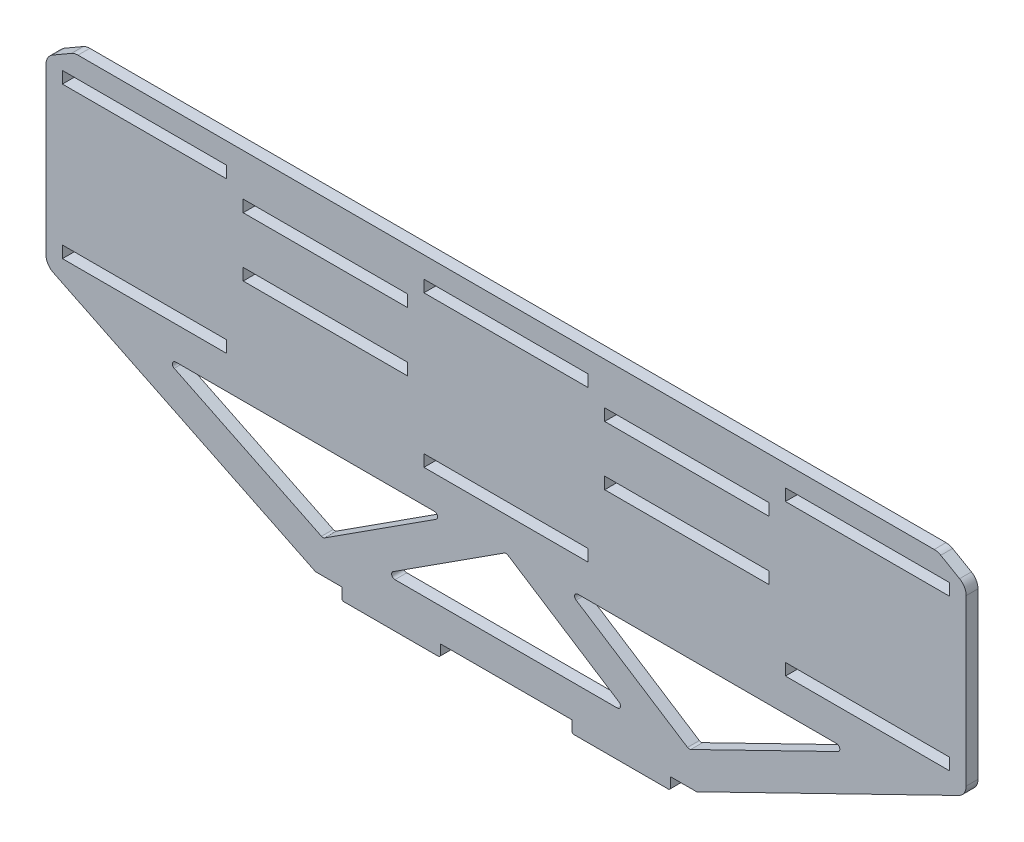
ISO-10303-21;
HEADER;
FILE_DESCRIPTION(('STEP AP214'),'2;1');
FILE_NAME('part.step','',(''),(''),'','','');
FILE_SCHEMA(('AUTOMOTIVE_DESIGN { 1 0 10303 214 1 1 1 1 }'));
ENDSEC;
DATA;
#1=APPLICATION_CONTEXT('core data for automotive mechanical design processes');
#2=APPLICATION_PROTOCOL_DEFINITION('international standard','automotive_design',2000,#1);
#3=PRODUCT_CONTEXT('',#1,'mechanical');
#4=PRODUCT('Part','Part','',(#3));
#5=PRODUCT_RELATED_PRODUCT_CATEGORY('part','',(#4));
#6=PRODUCT_DEFINITION_FORMATION('','',#4);
#7=PRODUCT_DEFINITION_CONTEXT('part definition',#1,'design');
#8=PRODUCT_DEFINITION('design','',#6,#7);
#9=PRODUCT_DEFINITION_SHAPE('','',#8);
#10=(LENGTH_UNIT() NAMED_UNIT(*) SI_UNIT(.MILLI.,.METRE.));
#11=(NAMED_UNIT(*) PLANE_ANGLE_UNIT() SI_UNIT($,.RADIAN.));
#12=(NAMED_UNIT(*) SI_UNIT($,.STERADIAN.) SOLID_ANGLE_UNIT());
#13=UNCERTAINTY_MEASURE_WITH_UNIT(LENGTH_MEASURE(1.E-05),#10,'distance_accuracy_value','');
#14=(GEOMETRIC_REPRESENTATION_CONTEXT(3) GLOBAL_UNCERTAINTY_ASSIGNED_CONTEXT((#13)) GLOBAL_UNIT_ASSIGNED_CONTEXT((#10,
#11,#12)) REPRESENTATION_CONTEXT('',''));
#15=CARTESIAN_POINT('',(0.,0.,0.));
#16=DIRECTION('',(0.,0.,1.));
#17=DIRECTION('',(1.,0.,0.));
#18=AXIS2_PLACEMENT_3D('',#15,#16,#17);
#19=CARTESIAN_POINT('',(0.,0.,18.));
#20=DIRECTION('',(0.,1.,0.));
#21=DIRECTION('',(0.,0.,1.));
#22=AXIS2_PLACEMENT_3D('',#19,#20,#21);
#23=PLANE('',#22);
#24=DIRECTION('',(0.,0.,1.));
#25=VECTOR('',#24,1.);
#26=CARTESIAN_POINT('',(950.,0.,18.));
#27=LINE('',#26,#25);
#28=CARTESIAN_POINT('',(950.,0.,0.));
#29=VERTEX_POINT('',#28);
#30=CARTESIAN_POINT('',(950.,0.,18.));
#31=VERTEX_POINT('',#30);
#32=EDGE_CURVE('E741',#29,#31,#27,.T.);
#33=ORIENTED_EDGE('',*,*,#32,.F.);
#34=DIRECTION('',(1.,0.,0.));
#35=VECTOR('',#34,1.);
#36=CARTESIAN_POINT('',(0.,0.,0.));
#37=LINE('',#36,#35);
#38=CARTESIAN_POINT('',(989.939231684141,0.,0.));
#39=VERTEX_POINT('',#38);
#40=EDGE_CURVE('E998',#29,#39,#37,.T.);
#41=ORIENTED_EDGE('',*,*,#40,.T.);
#42=DIRECTION('',(0.,0.,1.));
#43=VECTOR('',#42,1.);
#44=CARTESIAN_POINT('',(989.939231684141,0.,18.));
#45=LINE('',#44,#43);
#46=CARTESIAN_POINT('',(989.939231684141,0.,18.));
#47=VERTEX_POINT('',#46);
#48=EDGE_CURVE('E1015',#39,#47,#45,.T.);
#49=ORIENTED_EDGE('',*,*,#48,.T.);
#50=DIRECTION('',(1.,0.,0.));
#51=VECTOR('',#50,1.);
#52=CARTESIAN_POINT('',(0.,0.,18.));
#53=LINE('',#52,#51);
#54=EDGE_CURVE('E983',#31,#47,#53,.T.);
#55=ORIENTED_EDGE('',*,*,#54,.F.);
#56=EDGE_LOOP('',(#33,#41,#49,#55));
#57=FACE_BOUND('',#56,.T.);
#58=ADVANCED_FACE('F35',(#57),#23,.F.);
#59=DIRECTION('',(0.,0.,-1.));
#60=VECTOR('',#59,1.);
#61=CARTESIAN_POINT('',(800.,0.,18.));
#62=LINE('',#61,#60);
#63=CARTESIAN_POINT('',(800.,0.,18.));
#64=VERTEX_POINT('',#63);
#65=CARTESIAN_POINT('',(800.,0.,0.));
#66=VERTEX_POINT('',#65);
#67=EDGE_CURVE('E753',#64,#66,#62,.T.);
#68=ORIENTED_EDGE('',*,*,#67,.F.);
#69=CARTESIAN_POINT('',(600.,0.,18.));
#70=VERTEX_POINT('',#69);
#71=EDGE_CURVE('E989',#70,#64,#53,.T.);
#72=ORIENTED_EDGE('',*,*,#71,.F.);
#73=DIRECTION('',(0.,0.,1.));
#74=VECTOR('',#73,1.);
#75=CARTESIAN_POINT('',(600.,0.,18.));
#76=LINE('',#75,#74);
#77=CARTESIAN_POINT('',(600.,0.,0.));
#78=VERTEX_POINT('',#77);
#79=EDGE_CURVE('E772',#78,#70,#76,.T.);
#80=ORIENTED_EDGE('',*,*,#79,.F.);
#81=EDGE_CURVE('E1003',#78,#66,#37,.T.);
#82=ORIENTED_EDGE('',*,*,#81,.T.);
#83=EDGE_LOOP('',(#68,#72,#80,#82));
#84=FACE_BOUND('',#83,.T.);
#85=ADVANCED_FACE('F1294',(#84),#23,.F.);
#86=DIRECTION('',(0.,0.,-1.));
#87=VECTOR('',#86,1.);
#88=CARTESIAN_POINT('',(450.,0.,18.));
#89=LINE('',#88,#87);
#90=CARTESIAN_POINT('',(450.,0.,18.));
#91=VERTEX_POINT('',#90);
#92=CARTESIAN_POINT('',(450.,0.,0.));
#93=VERTEX_POINT('',#92);
#94=EDGE_CURVE('E768',#91,#93,#89,.T.);
#95=ORIENTED_EDGE('',*,*,#94,.F.);
#96=CARTESIAN_POINT('',(410.060768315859,0.,18.));
#97=VERTEX_POINT('',#96);
#98=EDGE_CURVE('E985',#97,#91,#53,.T.);
#99=ORIENTED_EDGE('',*,*,#98,.F.);
#100=DIRECTION('',(0.,0.,-1.));
#101=VECTOR('',#100,1.);
#102=CARTESIAN_POINT('',(410.060768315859,0.,18.));
#103=LINE('',#102,#101);
#104=CARTESIAN_POINT('',(410.060768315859,0.,0.));
#105=VERTEX_POINT('',#104);
#106=EDGE_CURVE('E1012',#97,#105,#103,.T.);
#107=ORIENTED_EDGE('',*,*,#106,.T.);
#108=EDGE_CURVE('E999',#105,#93,#37,.T.);
#109=ORIENTED_EDGE('',*,*,#108,.T.);
#110=EDGE_LOOP('',(#95,#99,#107,#109));
#111=FACE_BOUND('',#110,.T.);
#112=ADVANCED_FACE('F1226',(#111),#23,.F.);
#113=CARTESIAN_POINT('',(0.,0.,18.));
#114=DIRECTION('',(1.,0.,0.));
#115=DIRECTION('',(0.,0.,-1.));
#116=AXIS2_PLACEMENT_3D('',#113,#114,#115);
#117=PLANE('',#116);
#118=DIRECTION('',(0.,-1.,0.));
#119=VECTOR('',#118,1.);
#120=CARTESIAN_POINT('',(0.,0.,0.));
#121=LINE('',#120,#119);
#122=CARTESIAN_POINT('',(0.,463.452994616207,0.));
#123=VERTEX_POINT('',#122);
#124=CARTESIAN_POINT('',(0.,212.497387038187,0.));
#125=VERTEX_POINT('',#124);
#126=EDGE_CURVE('E973',#123,#125,#121,.T.);
#127=ORIENTED_EDGE('',*,*,#126,.T.);
#128=DIRECTION('',(0.,0.,-1.));
#129=VECTOR('',#128,1.);
#130=CARTESIAN_POINT('',(0.,212.497387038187,18.));
#131=LINE('',#130,#129);
#132=CARTESIAN_POINT('',(0.,212.497387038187,18.));
#133=VERTEX_POINT('',#132);
#134=EDGE_CURVE('E1070',#125,#133,#131,.F.);
#135=ORIENTED_EDGE('',*,*,#134,.T.);
#136=DIRECTION('',(0.,-1.,0.));
#137=VECTOR('',#136,1.);
#138=CARTESIAN_POINT('',(0.,0.,18.));
#139=LINE('',#138,#137);
#140=CARTESIAN_POINT('',(0.,463.452994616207,18.));
#141=VERTEX_POINT('',#140);
#142=EDGE_CURVE('E980',#141,#133,#139,.T.);
#143=ORIENTED_EDGE('',*,*,#142,.F.);
#144=DIRECTION('',(0.,0.,1.));
#145=VECTOR('',#144,1.);
#146=CARTESIAN_POINT('',(0.,463.452994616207,0.));
#147=LINE('',#146,#145);
#148=EDGE_CURVE('E1067',#141,#123,#147,.F.);
#149=ORIENTED_EDGE('',*,*,#148,.T.);
#150=EDGE_LOOP('',(#127,#135,#143,#149));
#151=FACE_BOUND('',#150,.T.);
#152=ADVANCED_FACE('F1240',(#151),#117,.F.);
#153=CARTESIAN_POINT('',(1400.,0.,18.));
#154=DIRECTION('',(-1.,0.,0.));
#155=DIRECTION('',(0.,0.,1.));
#156=AXIS2_PLACEMENT_3D('',#153,#154,#155);
#157=PLANE('',#156);
#158=DIRECTION('',(0.,1.,0.));
#159=VECTOR('',#158,1.);
#160=CARTESIAN_POINT('',(1400.,0.,18.));
#161=LINE('',#160,#159);
#162=CARTESIAN_POINT('',(1400.,212.497387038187,18.));
#163=VERTEX_POINT('',#162);
#164=CARTESIAN_POINT('',(1400.,463.452994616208,18.));
#165=VERTEX_POINT('',#164);
#166=EDGE_CURVE('E988',#163,#165,#161,.T.);
#167=ORIENTED_EDGE('',*,*,#166,.F.);
#168=DIRECTION('',(0.,0.,1.));
#169=VECTOR('',#168,1.);
#170=CARTESIAN_POINT('',(1400.,212.497387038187,0.));
#171=LINE('',#170,#169);
#172=CARTESIAN_POINT('',(1400.,212.497387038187,0.));
#173=VERTEX_POINT('',#172);
#174=EDGE_CURVE('E1038',#163,#173,#171,.F.);
#175=ORIENTED_EDGE('',*,*,#174,.T.);
#176=DIRECTION('',(0.,1.,0.));
#177=VECTOR('',#176,1.);
#178=CARTESIAN_POINT('',(1400.,0.,0.));
#179=LINE('',#178,#177);
#180=CARTESIAN_POINT('',(1400.,463.452994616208,0.));
#181=VERTEX_POINT('',#180);
#182=EDGE_CURVE('E1002',#173,#181,#179,.T.);
#183=ORIENTED_EDGE('',*,*,#182,.T.);
#184=DIRECTION('',(0.,0.,-1.));
#185=VECTOR('',#184,1.);
#186=CARTESIAN_POINT('',(1400.,463.452994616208,18.));
#187=LINE('',#186,#185);
#188=EDGE_CURVE('E1035',#181,#165,#187,.F.);
#189=ORIENTED_EDGE('',*,*,#188,.T.);
#190=EDGE_LOOP('',(#167,#175,#183,#189));
#191=FACE_BOUND('',#190,.T.);
#192=ADVANCED_FACE('F1276',(#191),#157,.F.);
#193=CARTESIAN_POINT('',(0.,500.,18.));
#194=DIRECTION('',(0.,-1.,0.));
#195=DIRECTION('',(0.,0.,-1.));
#196=AXIS2_PLACEMENT_3D('',#193,#194,#195);
#197=PLANE('',#196);
#198=DIRECTION('',(-1.,0.,0.));
#199=VECTOR('',#198,1.);
#200=CARTESIAN_POINT('',(0.,500.,18.));
#201=LINE('',#200,#199);
#202=CARTESIAN_POINT('',(1351.33974596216,500.,18.));
#203=VERTEX_POINT('',#202);
#204=CARTESIAN_POINT('',(48.6602540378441,500.,18.));
#205=VERTEX_POINT('',#204);
#206=EDGE_CURVE('E992',#203,#205,#201,.T.);
#207=ORIENTED_EDGE('',*,*,#206,.F.);
#208=DIRECTION('',(0.,0.,1.));
#209=VECTOR('',#208,1.);
#210=CARTESIAN_POINT('',(1351.33974596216,500.,0.));
#211=LINE('',#210,#209);
#212=CARTESIAN_POINT('',(1351.33974596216,500.,0.));
#213=VERTEX_POINT('',#212);
#214=EDGE_CURVE('E1082',#203,#213,#211,.F.);
#215=ORIENTED_EDGE('',*,*,#214,.T.);
#216=DIRECTION('',(-1.,0.,0.));
#217=VECTOR('',#216,1.);
#218=CARTESIAN_POINT('',(0.,500.,0.));
#219=LINE('',#218,#217);
#220=CARTESIAN_POINT('',(48.6602540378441,500.,0.));
#221=VERTEX_POINT('',#220);
#222=EDGE_CURVE('E984',#213,#221,#219,.T.);
#223=ORIENTED_EDGE('',*,*,#222,.T.);
#224=DIRECTION('',(0.,0.,-1.));
#225=VECTOR('',#224,1.);
#226=CARTESIAN_POINT('',(48.6602540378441,500.,18.));
#227=LINE('',#226,#225);
#228=EDGE_CURVE('E1079',#221,#205,#227,.F.);
#229=ORIENTED_EDGE('',*,*,#228,.T.);
#230=EDGE_LOOP('',(#207,#215,#223,#229));
#231=FACE_BOUND('',#230,.T.);
#232=ADVANCED_FACE('F1258',(#231),#197,.F.);
#233=CARTESIAN_POINT('',(0.,0.,18.));
#234=DIRECTION('',(0.,0.,-1.));
#235=DIRECTION('',(-1.,0.,0.));
#236=AXIS2_PLACEMENT_3D('',#233,#234,#235);
#237=PLANE('',#236);
#238=DIRECTION('',(1.,0.,0.));
#239=VECTOR('',#238,1.);
#240=CARTESIAN_POINT('',(850.,328.,18.));
#241=LINE('',#240,#239);
#242=CARTESIAN_POINT('',(850.,328.,18.));
#243=VERTEX_POINT('',#242);
#244=CARTESIAN_POINT('',(1100.,328.,18.));
#245=VERTEX_POINT('',#244);
#246=EDGE_CURVE('E615',#243,#245,#241,.T.);
#247=ORIENTED_EDGE('',*,*,#246,.F.);
#248=DIRECTION('',(0.,-1.,0.));
#249=VECTOR('',#248,1.);
#250=CARTESIAN_POINT('',(850.,346.,18.));
#251=LINE('',#250,#249);
#252=CARTESIAN_POINT('',(850.,346.,18.));
#253=VERTEX_POINT('',#252);
#254=EDGE_CURVE('E613',#253,#243,#251,.T.);
#255=ORIENTED_EDGE('',*,*,#254,.F.);
#256=DIRECTION('',(-1.,0.,0.));
#257=VECTOR('',#256,1.);
#258=CARTESIAN_POINT('',(850.,346.,18.));
#259=LINE('',#258,#257);
#260=CARTESIAN_POINT('',(1100.,346.,18.));
#261=VERTEX_POINT('',#260);
#262=EDGE_CURVE('E603',#261,#253,#259,.T.);
#263=ORIENTED_EDGE('',*,*,#262,.F.);
#264=DIRECTION('',(0.,1.,0.));
#265=VECTOR('',#264,1.);
#266=CARTESIAN_POINT('',(1100.,346.,18.));
#267=LINE('',#266,#265);
#268=EDGE_CURVE('E619',#245,#261,#267,.T.);
#269=ORIENTED_EDGE('',*,*,#268,.F.);
#270=EDGE_LOOP('',(#247,#255,#263,#269));
#271=FACE_BOUND('',#270,.T.);
#272=DIRECTION('',(1.,0.,0.));
#273=VECTOR('',#272,1.);
#274=CARTESIAN_POINT('',(300.,418.,18.));
#275=LINE('',#274,#273);
#276=CARTESIAN_POINT('',(300.,418.,18.));
#277=VERTEX_POINT('',#276);
#278=CARTESIAN_POINT('',(550.,418.,18.));
#279=VERTEX_POINT('',#278);
#280=EDGE_CURVE('E648',#277,#279,#275,.T.);
#281=ORIENTED_EDGE('',*,*,#280,.F.);
#282=DIRECTION('',(0.,-1.,0.));
#283=VECTOR('',#282,1.);
#284=CARTESIAN_POINT('',(300.,418.,18.));
#285=LINE('',#284,#283);
#286=CARTESIAN_POINT('',(300.,436.,18.));
#287=VERTEX_POINT('',#286);
#288=EDGE_CURVE('E595',#287,#277,#285,.T.);
#289=ORIENTED_EDGE('',*,*,#288,.F.);
#290=DIRECTION('',(-1.,0.,0.));
#291=VECTOR('',#290,1.);
#292=CARTESIAN_POINT('',(300.,436.,18.));
#293=LINE('',#292,#291);
#294=CARTESIAN_POINT('',(550.,436.,18.));
#295=VERTEX_POINT('',#294);
#296=EDGE_CURVE('E637',#295,#287,#293,.T.);
#297=ORIENTED_EDGE('',*,*,#296,.F.);
#298=DIRECTION('',(0.,1.,0.));
#299=VECTOR('',#298,1.);
#300=CARTESIAN_POINT('',(550.,418.,18.));
#301=LINE('',#300,#299);
#302=EDGE_CURVE('E651',#279,#295,#301,.T.);
#303=ORIENTED_EDGE('',*,*,#302,.F.);
#304=EDGE_LOOP('',(#281,#289,#297,#303));
#305=FACE_BOUND('',#304,.T.);
#306=DIRECTION('',(1.,0.,0.));
#307=VECTOR('',#306,1.);
#308=CARTESIAN_POINT('',(850.,418.,18.));
#309=LINE('',#308,#307);
#310=CARTESIAN_POINT('',(850.,418.,18.));
#311=VERTEX_POINT('',#310);
#312=CARTESIAN_POINT('',(1100.,418.,18.));
#313=VERTEX_POINT('',#312);
#314=EDGE_CURVE('E589',#311,#313,#309,.T.);
#315=ORIENTED_EDGE('',*,*,#314,.F.);
#316=DIRECTION('',(0.,-1.,0.));
#317=VECTOR('',#316,1.);
#318=CARTESIAN_POINT('',(850.,436.,18.));
#319=LINE('',#318,#317);
#320=CARTESIAN_POINT('',(850.,436.,18.));
#321=VERTEX_POINT('',#320);
#322=EDGE_CURVE('E562',#321,#311,#319,.T.);
#323=ORIENTED_EDGE('',*,*,#322,.F.);
#324=DIRECTION('',(-1.,0.,0.));
#325=VECTOR('',#324,1.);
#326=CARTESIAN_POINT('',(850.,436.,18.));
#327=LINE('',#326,#325);
#328=CARTESIAN_POINT('',(1100.,436.,18.));
#329=VERTEX_POINT('',#328);
#330=EDGE_CURVE('E580',#329,#321,#327,.T.);
#331=ORIENTED_EDGE('',*,*,#330,.F.);
#332=DIRECTION('',(0.,1.,0.));
#333=VECTOR('',#332,1.);
#334=CARTESIAN_POINT('',(1100.,436.,18.));
#335=LINE('',#334,#333);
#336=EDGE_CURVE('E583',#313,#329,#335,.T.);
#337=ORIENTED_EDGE('',*,*,#336,.F.);
#338=EDGE_LOOP('',(#315,#323,#331,#337));
#339=FACE_BOUND('',#338,.T.);
#340=DIRECTION('',(1.,0.,0.));
#341=VECTOR('',#340,1.);
#342=CARTESIAN_POINT('',(300.,328.,18.));
#343=LINE('',#342,#341);
#344=CARTESIAN_POINT('',(300.,328.,18.));
#345=VERTEX_POINT('',#344);
#346=CARTESIAN_POINT('',(550.,328.,18.));
#347=VERTEX_POINT('',#346);
#348=EDGE_CURVE('E678',#345,#347,#343,.T.);
#349=ORIENTED_EDGE('',*,*,#348,.F.);
#350=DIRECTION('',(0.,-1.,0.));
#351=VECTOR('',#350,1.);
#352=CARTESIAN_POINT('',(300.,346.,18.));
#353=LINE('',#352,#351);
#354=CARTESIAN_POINT('',(300.,346.,18.));
#355=VERTEX_POINT('',#354);
#356=EDGE_CURVE('E626',#355,#345,#353,.T.);
#357=ORIENTED_EDGE('',*,*,#356,.F.);
#358=DIRECTION('',(-1.,0.,0.));
#359=VECTOR('',#358,1.);
#360=CARTESIAN_POINT('',(300.,346.,18.));
#361=LINE('',#360,#359);
#362=CARTESIAN_POINT('',(550.,346.,18.));
#363=VERTEX_POINT('',#362);
#364=EDGE_CURVE('E667',#363,#355,#361,.T.);
#365=ORIENTED_EDGE('',*,*,#364,.F.);
#366=DIRECTION('',(0.,1.,0.));
#367=VECTOR('',#366,1.);
#368=CARTESIAN_POINT('',(550.,346.,18.));
#369=LINE('',#368,#367);
#370=EDGE_CURVE('E681',#347,#363,#369,.T.);
#371=ORIENTED_EDGE('',*,*,#370,.F.);
#372=EDGE_LOOP('',(#349,#357,#365,#371));
#373=FACE_BOUND('',#372,.T.);
#374=DIRECTION('',(-0.840460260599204,-0.541873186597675,0.));
#375=VECTOR('',#374,1.);
#376=CARTESIAN_POINT('',(700.,170.,18.));
#377=LINE('',#376,#375);
#378=CARTESIAN_POINT('',(697.290634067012,168.253180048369,18.));
#379=VERTEX_POINT('',#378);
#380=CARTESIAN_POINT('',(528.149712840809,59.202301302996,18.));
#381=VERTEX_POINT('',#380);
#382=EDGE_CURVE('E726',#379,#381,#377,.T.);
#383=ORIENTED_EDGE('',*,*,#382,.F.);
#384=CARTESIAN_POINT('',(700.,164.050878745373,18.));
#385=DIRECTION('',(0.,0.,-1.));
#386=DIRECTION('',(-1.,0.,0.));
#387=AXIS2_PLACEMENT_3D('',#384,#385,#386);
#388=CIRCLE('',#387,5.);
#389=CARTESIAN_POINT('',(702.709365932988,168.253180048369,18.));
#390=VERTEX_POINT('',#389);
#391=EDGE_CURVE('E1162',#379,#390,#388,.T.);
#392=ORIENTED_EDGE('',*,*,#391,.T.);
#393=DIRECTION('',(-0.840460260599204,0.541873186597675,0.));
#394=VECTOR('',#393,1.);
#395=CARTESIAN_POINT('',(700.,170.,18.));
#396=LINE('',#395,#394);
#397=CARTESIAN_POINT('',(871.85028715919,59.202301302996,18.));
#398=VERTEX_POINT('',#397);
#399=EDGE_CURVE('E705',#398,#390,#396,.T.);
#400=ORIENTED_EDGE('',*,*,#399,.F.);
#401=CARTESIAN_POINT('',(869.140921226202,55.,18.));
#402=DIRECTION('',(0.,0.,-1.));
#403=DIRECTION('',(-1.,0.,0.));
#404=AXIS2_PLACEMENT_3D('',#401,#402,#403);
#405=CIRCLE('',#404,5.);
#406=CARTESIAN_POINT('',(869.140921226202,50.,18.));
#407=VERTEX_POINT('',#406);
#408=EDGE_CURVE('E1146',#398,#407,#405,.T.);
#409=ORIENTED_EDGE('',*,*,#408,.T.);
#410=DIRECTION('',(1.,0.,0.));
#411=VECTOR('',#410,1.);
#412=CARTESIAN_POINT('',(513.876689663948,50.,18.));
#413=LINE('',#412,#411);
#414=CARTESIAN_POINT('',(530.859078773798,50.,18.));
#415=VERTEX_POINT('',#414);
#416=EDGE_CURVE('E717',#415,#407,#413,.T.);
#417=ORIENTED_EDGE('',*,*,#416,.F.);
#418=CARTESIAN_POINT('',(530.859078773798,55.,18.));
#419=DIRECTION('',(0.,0.,-1.));
#420=DIRECTION('',(-1.,0.,0.));
#421=AXIS2_PLACEMENT_3D('',#418,#419,#420);
#422=CIRCLE('',#421,5.);
#423=EDGE_CURVE('E1150',#415,#381,#422,.T.);
#424=ORIENTED_EDGE('',*,*,#423,.T.);
#425=EDGE_LOOP('',(#383,#392,#400,#409,#417,#424));
#426=FACE_BOUND('',#425,.T.);
#427=DIRECTION('',(0.898794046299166,0.438371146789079,0.));
#428=VECTOR('',#427,1.);
#429=CARTESIAN_POINT('',(1224.43228311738,170.,18.));
#430=LINE('',#429,#428);
#431=CARTESIAN_POINT('',(980.928625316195,51.2353306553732,18.));
#432=VERTEX_POINT('',#431);
#433=CARTESIAN_POINT('',(1204.9667594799,160.506029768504,18.));
#434=VERTEX_POINT('',#433);
#435=EDGE_CURVE('E708',#432,#434,#430,.T.);
#436=ORIENTED_EDGE('',*,*,#435,.F.);
#437=CARTESIAN_POINT('',(978.73676958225,55.729300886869,18.));
#438=DIRECTION('',(0.,0.,-1.));
#439=DIRECTION('',(-1.,0.,0.));
#440=AXIS2_PLACEMENT_3D('',#437,#438,#439);
#441=CIRCLE('',#440,5.);
#442=CARTESIAN_POINT('',(976.027403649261,51.5269995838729,18.));
#443=VERTEX_POINT('',#442);
#444=EDGE_CURVE('E1134',#432,#443,#441,.T.);
#445=ORIENTED_EDGE('',*,*,#444,.T.);
#446=DIRECTION('',(0.840460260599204,-0.541873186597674,0.));
#447=VECTOR('',#446,1.);
#448=CARTESIAN_POINT('',(978.395822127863,50.0000000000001,18.));
#449=LINE('',#448,#447);
#450=CARTESIAN_POINT('',(806.545534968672,160.797698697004,18.));
#451=VERTEX_POINT('',#450);
#452=EDGE_CURVE('E688',#451,#443,#449,.T.);
#453=ORIENTED_EDGE('',*,*,#452,.F.);
#454=CARTESIAN_POINT('',(809.254900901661,165.,18.));
#455=DIRECTION('',(0.,0.,-1.));
#456=DIRECTION('',(-1.,0.,0.));
#457=AXIS2_PLACEMENT_3D('',#454,#455,#456);
#458=CIRCLE('',#457,5.);
#459=CARTESIAN_POINT('',(809.254900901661,170.,18.));
#460=VERTEX_POINT('',#459);
#461=EDGE_CURVE('E1142',#451,#460,#458,.T.);
#462=ORIENTED_EDGE('',*,*,#461,.T.);
#463=DIRECTION('',(-1.,0.,0.));
#464=VECTOR('',#463,1.);
#465=CARTESIAN_POINT('',(792.272511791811,170.,18.));
#466=LINE('',#465,#464);
#467=CARTESIAN_POINT('',(1202.77490374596,170.,18.));
#468=VERTEX_POINT('',#467);
#469=EDGE_CURVE('E699',#468,#460,#466,.T.);
#470=ORIENTED_EDGE('',*,*,#469,.F.);
#471=CARTESIAN_POINT('',(1202.77490374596,165.,18.));
#472=DIRECTION('',(0.,0.,-1.));
#473=DIRECTION('',(-1.,0.,0.));
#474=AXIS2_PLACEMENT_3D('',#471,#472,#473);
#475=CIRCLE('',#474,5.);
#476=EDGE_CURVE('E1138',#468,#434,#475,.T.);
#477=ORIENTED_EDGE('',*,*,#476,.T.);
#478=EDGE_LOOP('',(#436,#445,#453,#462,#470,#477));
#479=FACE_BOUND('',#478,.T.);
#480=DIRECTION('',(0.898794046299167,-0.438371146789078,0.));
#481=VECTOR('',#480,1.);
#482=CARTESIAN_POINT('',(175.567716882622,170.,18.));
#483=LINE('',#482,#481);
#484=CARTESIAN_POINT('',(195.033240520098,160.506029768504,18.));
#485=VERTEX_POINT('',#484);
#486=CARTESIAN_POINT('',(419.071374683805,51.2353306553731,18.));
#487=VERTEX_POINT('',#486);
#488=EDGE_CURVE('E744',#485,#487,#483,.T.);
#489=ORIENTED_EDGE('',*,*,#488,.F.);
#490=CARTESIAN_POINT('',(197.225096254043,165.,18.));
#491=DIRECTION('',(0.,0.,-1.));
#492=DIRECTION('',(-1.,0.,0.));
#493=AXIS2_PLACEMENT_3D('',#490,#491,#492);
#494=CIRCLE('',#493,5.);
#495=CARTESIAN_POINT('',(197.225096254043,170.,18.));
#496=VERTEX_POINT('',#495);
#497=EDGE_CURVE('E1158',#485,#496,#494,.T.);
#498=ORIENTED_EDGE('',*,*,#497,.T.);
#499=DIRECTION('',(-1.,0.,0.));
#500=VECTOR('',#499,1.);
#501=CARTESIAN_POINT('',(607.727488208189,170.,18.));
#502=LINE('',#501,#500);
#503=CARTESIAN_POINT('',(590.745099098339,170.,18.));
#504=VERTEX_POINT('',#503);
#505=EDGE_CURVE('E723',#504,#496,#502,.T.);
#506=ORIENTED_EDGE('',*,*,#505,.F.);
#507=CARTESIAN_POINT('',(590.745099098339,165.,18.));
#508=DIRECTION('',(0.,0.,-1.));
#509=DIRECTION('',(-1.,0.,0.));
#510=AXIS2_PLACEMENT_3D('',#507,#508,#509);
#511=CIRCLE('',#510,5.);
#512=CARTESIAN_POINT('',(593.454465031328,160.797698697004,18.));
#513=VERTEX_POINT('',#512);
#514=EDGE_CURVE('E1166',#504,#513,#511,.T.);
#515=ORIENTED_EDGE('',*,*,#514,.T.);
#516=DIRECTION('',(0.840460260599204,0.541873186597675,0.));
#517=VECTOR('',#516,1.);
#518=CARTESIAN_POINT('',(421.604177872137,50.,18.));
#519=LINE('',#518,#517);
#520=CARTESIAN_POINT('',(423.972596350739,51.5269995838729,18.));
#521=VERTEX_POINT('',#520);
#522=EDGE_CURVE('E735',#521,#513,#519,.T.);
#523=ORIENTED_EDGE('',*,*,#522,.F.);
#524=CARTESIAN_POINT('',(421.26323041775,55.7293008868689,18.));
#525=DIRECTION('',(0.,0.,-1.));
#526=DIRECTION('',(-1.,0.,0.));
#527=AXIS2_PLACEMENT_3D('',#524,#525,#526);
#528=CIRCLE('',#527,5.);
#529=EDGE_CURVE('E1154',#521,#487,#528,.T.);
#530=ORIENTED_EDGE('',*,*,#529,.T.);
#531=EDGE_LOOP('',(#489,#498,#506,#515,#523,#530));
#532=FACE_BOUND('',#531,.T.);
#533=DIRECTION('',(-1.,0.,0.));
#534=VECTOR('',#533,1.);
#535=CARTESIAN_POINT('',(275.,468.,18.));
#536=LINE('',#535,#534);
#537=CARTESIAN_POINT('',(275.,468.,18.));
#538=VERTEX_POINT('',#537);
#539=CARTESIAN_POINT('',(24.9999999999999,468.,18.));
#540=VERTEX_POINT('',#539);
#541=EDGE_CURVE('E933',#538,#540,#536,.T.);
#542=ORIENTED_EDGE('',*,*,#541,.F.);
#543=DIRECTION('',(0.,1.,0.));
#544=VECTOR('',#543,1.);
#545=CARTESIAN_POINT('',(275.,450.,18.));
#546=LINE('',#545,#544);
#547=CARTESIAN_POINT('',(275.,450.,18.));
#548=VERTEX_POINT('',#547);
#549=EDGE_CURVE('E787',#548,#538,#546,.T.);
#550=ORIENTED_EDGE('',*,*,#549,.F.);
#551=DIRECTION('',(1.,0.,0.));
#552=VECTOR('',#551,1.);
#553=CARTESIAN_POINT('',(275.,450.,18.));
#554=LINE('',#553,#552);
#555=CARTESIAN_POINT('',(24.9999999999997,450.,18.));
#556=VERTEX_POINT('',#555);
#557=EDGE_CURVE('E922',#556,#548,#554,.T.);
#558=ORIENTED_EDGE('',*,*,#557,.F.);
#559=DIRECTION('',(0.,-1.,0.));
#560=VECTOR('',#559,1.);
#561=CARTESIAN_POINT('',(24.9999999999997,450.,18.));
#562=LINE('',#561,#560);
#563=EDGE_CURVE('E936',#540,#556,#562,.T.);
#564=ORIENTED_EDGE('',*,*,#563,.F.);
#565=EDGE_LOOP('',(#542,#550,#558,#564));
#566=FACE_BOUND('',#565,.T.);
#567=DIRECTION('',(-1.,0.,0.));
#568=VECTOR('',#567,1.);
#569=CARTESIAN_POINT('',(825.,468.,18.));
#570=LINE('',#569,#568);
#571=CARTESIAN_POINT('',(825.,468.,18.));
#572=VERTEX_POINT('',#571);
#573=CARTESIAN_POINT('',(575.,468.,18.));
#574=VERTEX_POINT('',#573);
#575=EDGE_CURVE('E902',#572,#574,#570,.T.);
#576=ORIENTED_EDGE('',*,*,#575,.F.);
#577=DIRECTION('',(0.,1.,0.));
#578=VECTOR('',#577,1.);
#579=CARTESIAN_POINT('',(825.,468.,18.));
#580=LINE('',#579,#578);
#581=CARTESIAN_POINT('',(825.,450.,18.));
#582=VERTEX_POINT('',#581);
#583=EDGE_CURVE('E900',#582,#572,#580,.T.);
#584=ORIENTED_EDGE('',*,*,#583,.F.);
#585=DIRECTION('',(1.,0.,0.));
#586=VECTOR('',#585,1.);
#587=CARTESIAN_POINT('',(825.,450.,18.));
#588=LINE('',#587,#586);
#589=CARTESIAN_POINT('',(575.,450.,18.));
#590=VERTEX_POINT('',#589);
#591=EDGE_CURVE('E890',#590,#582,#588,.T.);
#592=ORIENTED_EDGE('',*,*,#591,.F.);
#593=DIRECTION('',(0.,-1.,0.));
#594=VECTOR('',#593,1.);
#595=CARTESIAN_POINT('',(575.,468.,18.));
#596=LINE('',#595,#594);
#597=EDGE_CURVE('E906',#574,#590,#596,.T.);
#598=ORIENTED_EDGE('',*,*,#597,.F.);
#599=EDGE_LOOP('',(#576,#584,#592,#598));
#600=FACE_BOUND('',#599,.T.);
#601=DIRECTION('',(-1.,0.,0.));
#602=VECTOR('',#601,1.);
#603=CARTESIAN_POINT('',(1375.,468.,18.));
#604=LINE('',#603,#602);
#605=CARTESIAN_POINT('',(1375.,468.,18.));
#606=VERTEX_POINT('',#605);
#607=CARTESIAN_POINT('',(1125.,468.,18.));
#608=VERTEX_POINT('',#607);
#609=EDGE_CURVE('E870',#606,#608,#604,.T.);
#610=ORIENTED_EDGE('',*,*,#609,.F.);
#611=DIRECTION('',(0.,1.,0.));
#612=VECTOR('',#611,1.);
#613=CARTESIAN_POINT('',(1375.,450.,18.));
#614=LINE('',#613,#612);
#615=CARTESIAN_POINT('',(1375.,450.,18.));
#616=VERTEX_POINT('',#615);
#617=EDGE_CURVE('E868',#616,#606,#614,.T.);
#618=ORIENTED_EDGE('',*,*,#617,.F.);
#619=DIRECTION('',(1.,0.,0.));
#620=VECTOR('',#619,1.);
#621=CARTESIAN_POINT('',(1375.,450.,18.));
#622=LINE('',#621,#620);
#623=CARTESIAN_POINT('',(1125.,450.,18.));
#624=VERTEX_POINT('',#623);
#625=EDGE_CURVE('E858',#624,#616,#622,.T.);
#626=ORIENTED_EDGE('',*,*,#625,.F.);
#627=DIRECTION('',(0.,-1.,0.));
#628=VECTOR('',#627,1.);
#629=CARTESIAN_POINT('',(1125.,450.,18.));
#630=LINE('',#629,#628);
#631=EDGE_CURVE('E874',#608,#624,#630,.T.);
#632=ORIENTED_EDGE('',*,*,#631,.F.);
#633=EDGE_LOOP('',(#610,#618,#626,#632));
#634=FACE_BOUND('',#633,.T.);
#635=DIRECTION('',(1.,0.,0.));
#636=VECTOR('',#635,1.);
#637=CARTESIAN_POINT('',(1125.,220.,18.));
#638=LINE('',#637,#636);
#639=CARTESIAN_POINT('',(1125.,220.,18.));
#640=VERTEX_POINT('',#639);
#641=CARTESIAN_POINT('',(1375.,220.,18.));
#642=VERTEX_POINT('',#641);
#643=EDGE_CURVE('E838',#640,#642,#638,.T.);
#644=ORIENTED_EDGE('',*,*,#643,.F.);
#645=DIRECTION('',(0.,-1.,0.));
#646=VECTOR('',#645,1.);
#647=CARTESIAN_POINT('',(1125.,238.,18.));
#648=LINE('',#647,#646);
#649=CARTESIAN_POINT('',(1125.,238.,18.));
#650=VERTEX_POINT('',#649);
#651=EDGE_CURVE('E836',#650,#640,#648,.T.);
#652=ORIENTED_EDGE('',*,*,#651,.F.);
#653=DIRECTION('',(-1.,0.,0.));
#654=VECTOR('',#653,1.);
#655=CARTESIAN_POINT('',(1125.,238.,18.));
#656=LINE('',#655,#654);
#657=CARTESIAN_POINT('',(1375.,238.,18.));
#658=VERTEX_POINT('',#657);
#659=EDGE_CURVE('E826',#658,#650,#656,.T.);
#660=ORIENTED_EDGE('',*,*,#659,.F.);
#661=DIRECTION('',(0.,1.,0.));
#662=VECTOR('',#661,1.);
#663=CARTESIAN_POINT('',(1375.,238.,18.));
#664=LINE('',#663,#662);
#665=EDGE_CURVE('E842',#642,#658,#664,.T.);
#666=ORIENTED_EDGE('',*,*,#665,.F.);
#667=EDGE_LOOP('',(#644,#652,#660,#666));
#668=FACE_BOUND('',#667,.T.);
#669=DIRECTION('',(1.,0.,0.));
#670=VECTOR('',#669,1.);
#671=CARTESIAN_POINT('',(575.,220.,18.));
#672=LINE('',#671,#670);
#673=CARTESIAN_POINT('',(575.,220.,18.));
#674=VERTEX_POINT('',#673);
#675=CARTESIAN_POINT('',(825.,220.,18.));
#676=VERTEX_POINT('',#675);
#677=EDGE_CURVE('E804',#674,#676,#672,.T.);
#678=ORIENTED_EDGE('',*,*,#677,.F.);
#679=DIRECTION('',(0.,-1.,0.));
#680=VECTOR('',#679,1.);
#681=CARTESIAN_POINT('',(575.,237.999999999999,18.));
#682=LINE('',#681,#680);
#683=CARTESIAN_POINT('',(575.,237.999999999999,18.));
#684=VERTEX_POINT('',#683);
#685=EDGE_CURVE('E802',#684,#674,#682,.T.);
#686=ORIENTED_EDGE('',*,*,#685,.F.);
#687=DIRECTION('',(-1.,0.,0.));
#688=VECTOR('',#687,1.);
#689=CARTESIAN_POINT('',(575.,237.999999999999,18.));
#690=LINE('',#689,#688);
#691=CARTESIAN_POINT('',(825.,237.999999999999,18.));
#692=VERTEX_POINT('',#691);
#693=EDGE_CURVE('E792',#692,#684,#690,.T.);
#694=ORIENTED_EDGE('',*,*,#693,.F.);
#695=DIRECTION('',(0.,1.,0.));
#696=VECTOR('',#695,1.);
#697=CARTESIAN_POINT('',(825.,237.999999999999,18.));
#698=LINE('',#697,#696);
#699=EDGE_CURVE('E808',#676,#692,#698,.T.);
#700=ORIENTED_EDGE('',*,*,#699,.F.);
#701=EDGE_LOOP('',(#678,#686,#694,#700));
#702=FACE_BOUND('',#701,.T.);
#703=DIRECTION('',(1.,0.,0.));
#704=VECTOR('',#703,1.);
#705=CARTESIAN_POINT('',(25.,220.,18.));
#706=LINE('',#705,#704);
#707=CARTESIAN_POINT('',(25.,220.,18.));
#708=VERTEX_POINT('',#707);
#709=CARTESIAN_POINT('',(275.,220.,18.));
#710=VERTEX_POINT('',#709);
#711=EDGE_CURVE('E963',#708,#710,#706,.T.);
#712=ORIENTED_EDGE('',*,*,#711,.F.);
#713=DIRECTION('',(0.,-1.,0.));
#714=VECTOR('',#713,1.);
#715=CARTESIAN_POINT('',(25.,237.999999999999,18.));
#716=LINE('',#715,#714);
#717=CARTESIAN_POINT('',(25.,237.999999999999,18.));
#718=VERTEX_POINT('',#717);
#719=EDGE_CURVE('E815',#718,#708,#716,.T.);
#720=ORIENTED_EDGE('',*,*,#719,.F.);
#721=DIRECTION('',(-1.,0.,0.));
#722=VECTOR('',#721,1.);
#723=CARTESIAN_POINT('',(25.,237.999999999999,18.));
#724=LINE('',#723,#722);
#725=CARTESIAN_POINT('',(275.,237.999999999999,18.));
#726=VERTEX_POINT('',#725);
#727=EDGE_CURVE('E952',#726,#718,#724,.T.);
#728=ORIENTED_EDGE('',*,*,#727,.F.);
#729=DIRECTION('',(0.,1.,0.));
#730=VECTOR('',#729,1.);
#731=CARTESIAN_POINT('',(275.,237.999999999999,18.));
#732=LINE('',#731,#730);
#733=EDGE_CURVE('E966',#710,#726,#732,.T.);
#734=ORIENTED_EDGE('',*,*,#733,.F.);
#735=EDGE_LOOP('',(#712,#720,#728,#734));
#736=FACE_BOUND('',#735,.T.);
#737=DIRECTION('',(-1.,0.,0.));
#738=VECTOR('',#737,1.);
#739=CARTESIAN_POINT('',(950.,-18.,18.));
#740=LINE('',#739,#738);
#741=CARTESIAN_POINT('',(948.,-18.,18.));
#742=VERTEX_POINT('',#741);
#743=CARTESIAN_POINT('',(802.,-18.,18.));
#744=VERTEX_POINT('',#743);
#745=EDGE_CURVE('E749',#742,#744,#740,.T.);
#746=ORIENTED_EDGE('',*,*,#745,.F.);
#747=DIRECTION('',(-0.707106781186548,-0.707106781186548,0.));
#748=VECTOR('',#747,1.);
#749=CARTESIAN_POINT('',(948.,-17.9999999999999,18.));
#750=LINE('',#749,#748);
#751=CARTESIAN_POINT('',(950.,-16.0000000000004,18.));
#752=VERTEX_POINT('',#751);
#753=EDGE_CURVE('E1182',#742,#752,#750,.F.);
#754=ORIENTED_EDGE('',*,*,#753,.T.);
#755=DIRECTION('',(0.,1.,0.));
#756=VECTOR('',#755,1.);
#757=CARTESIAN_POINT('',(950.,-18.,18.));
#758=LINE('',#757,#756);
#759=EDGE_CURVE('E766',#752,#31,#758,.T.);
#760=ORIENTED_EDGE('',*,*,#759,.T.);
#761=ORIENTED_EDGE('',*,*,#54,.T.);
#762=DIRECTION('',(-0.898794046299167,-0.438371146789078,0.));
#763=VECTOR('',#762,1.);
#764=CARTESIAN_POINT('',(1400.,200.,18.));
#765=LINE('',#764,#763);
#766=CARTESIAN_POINT('',(1388.76742293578,194.521506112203,18.));
#767=VERTEX_POINT('',#766);
#768=EDGE_CURVE('E1020',#47,#767,#765,.F.);
#769=ORIENTED_EDGE('',*,*,#768,.T.);
#770=CARTESIAN_POINT('',(1380.,212.497387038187,18.));
#771=DIRECTION('',(0.,0.,-1.));
#772=DIRECTION('',(-1.,0.,0.));
#773=AXIS2_PLACEMENT_3D('',#770,#771,#772);
#774=CIRCLE('',#773,20.);
#775=EDGE_CURVE('E1065',#767,#163,#774,.F.);
#776=ORIENTED_EDGE('',*,*,#775,.T.);
#777=ORIENTED_EDGE('',*,*,#166,.T.);
#778=CARTESIAN_POINT('',(1380.,463.452994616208,18.));
#779=DIRECTION('',(0.,0.,-1.));
#780=DIRECTION('',(-1.,0.,0.));
#781=AXIS2_PLACEMENT_3D('',#778,#779,#780);
#782=CIRCLE('',#781,20.);
#783=CARTESIAN_POINT('',(1390.,480.773502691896,18.));
#784=VERTEX_POINT('',#783);
#785=EDGE_CURVE('E1061',#165,#784,#782,.F.);
#786=ORIENTED_EDGE('',*,*,#785,.T.);
#787=DIRECTION('',(0.86602540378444,-0.499999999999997,0.));
#788=VECTOR('',#787,1.);
#789=CARTESIAN_POINT('',(1356.69872981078,500.,18.));
#790=LINE('',#789,#788);
#791=CARTESIAN_POINT('',(1361.33974596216,497.320508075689,18.));
#792=VERTEX_POINT('',#791);
#793=EDGE_CURVE('E1032',#784,#792,#790,.F.);
#794=ORIENTED_EDGE('',*,*,#793,.T.);
#795=CARTESIAN_POINT('',(1351.33974596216,480.,18.));
#796=DIRECTION('',(0.,0.,-1.));
#797=DIRECTION('',(-1.,0.,0.));
#798=AXIS2_PLACEMENT_3D('',#795,#796,#797);
#799=CIRCLE('',#798,20.);
#800=EDGE_CURVE('E1059',#792,#203,#799,.F.);
#801=ORIENTED_EDGE('',*,*,#800,.T.);
#802=ORIENTED_EDGE('',*,*,#206,.T.);
#803=CARTESIAN_POINT('',(48.6602540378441,480.,18.));
#804=DIRECTION('',(0.,0.,-1.));
#805=DIRECTION('',(-1.,0.,0.));
#806=AXIS2_PLACEMENT_3D('',#803,#804,#805);
#807=CIRCLE('',#806,20.);
#808=CARTESIAN_POINT('',(38.6602540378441,497.320508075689,18.));
#809=VERTEX_POINT('',#808);
#810=EDGE_CURVE('E1055',#205,#809,#807,.F.);
#811=ORIENTED_EDGE('',*,*,#810,.T.);
#812=DIRECTION('',(0.866025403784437,0.500000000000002,0.));
#813=VECTOR('',#812,1.);
#814=CARTESIAN_POINT('',(0.,475.,18.));
#815=LINE('',#814,#813);
#816=CARTESIAN_POINT('',(9.99999999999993,480.773502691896,18.));
#817=VERTEX_POINT('',#816);
#818=EDGE_CURVE('E1029',#809,#817,#815,.F.);
#819=ORIENTED_EDGE('',*,*,#818,.T.);
#820=CARTESIAN_POINT('',(20.,463.452994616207,18.));
#821=DIRECTION('',(0.,0.,-1.));
#822=DIRECTION('',(-1.,0.,0.));
#823=AXIS2_PLACEMENT_3D('',#820,#821,#822);
#824=CIRCLE('',#823,20.);
#825=EDGE_CURVE('E1057',#817,#141,#824,.F.);
#826=ORIENTED_EDGE('',*,*,#825,.T.);
#827=ORIENTED_EDGE('',*,*,#142,.T.);
#828=CARTESIAN_POINT('',(20.,212.497387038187,18.));
#829=DIRECTION('',(0.,0.,-1.));
#830=DIRECTION('',(-1.,0.,0.));
#831=AXIS2_PLACEMENT_3D('',#828,#829,#830);
#832=CIRCLE('',#831,20.);
#833=CARTESIAN_POINT('',(11.2325770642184,194.521506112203,18.));
#834=VERTEX_POINT('',#833);
#835=EDGE_CURVE('E1063',#133,#834,#832,.F.);
#836=ORIENTED_EDGE('',*,*,#835,.T.);
#837=DIRECTION('',(-0.898794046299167,0.438371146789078,0.));
#838=VECTOR('',#837,1.);
#839=CARTESIAN_POINT('',(410.060768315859,0.,18.));
#840=LINE('',#839,#838);
#841=EDGE_CURVE('E1018',#834,#97,#840,.F.);
#842=ORIENTED_EDGE('',*,*,#841,.T.);
#843=ORIENTED_EDGE('',*,*,#98,.T.);
#844=DIRECTION('',(0.,1.,0.));
#845=VECTOR('',#844,1.);
#846=CARTESIAN_POINT('',(450.,-18.,18.));
#847=LINE('',#846,#845);
#848=CARTESIAN_POINT('',(450.,-16.0000000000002,18.));
#849=VERTEX_POINT('',#848);
#850=EDGE_CURVE('E775',#849,#91,#847,.T.);
#851=ORIENTED_EDGE('',*,*,#850,.F.);
#852=DIRECTION('',(0.707106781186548,-0.707106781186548,0.));
#853=VECTOR('',#852,1.);
#854=CARTESIAN_POINT('',(452.,-18.,18.));
#855=LINE('',#854,#853);
#856=CARTESIAN_POINT('',(452.,-18.,18.));
#857=VERTEX_POINT('',#856);
#858=EDGE_CURVE('E1176',#849,#857,#855,.T.);
#859=ORIENTED_EDGE('',*,*,#858,.T.);
#860=DIRECTION('',(-1.,0.,0.));
#861=VECTOR('',#860,1.);
#862=CARTESIAN_POINT('',(450.,-18.,18.));
#863=LINE('',#862,#861);
#864=CARTESIAN_POINT('',(598.,-18.,18.));
#865=VERTEX_POINT('',#864);
#866=EDGE_CURVE('E771',#865,#857,#863,.T.);
#867=ORIENTED_EDGE('',*,*,#866,.F.);
#868=DIRECTION('',(0.707106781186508,0.707106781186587,0.));
#869=VECTOR('',#868,1.);
#870=CARTESIAN_POINT('',(598.,-18.,18.));
#871=LINE('',#870,#869);
#872=CARTESIAN_POINT('',(600.,-15.9999999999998,18.));
#873=VERTEX_POINT('',#872);
#874=EDGE_CURVE('E1178',#865,#873,#871,.T.);
#875=ORIENTED_EDGE('',*,*,#874,.T.);
#876=DIRECTION('',(0.,1.,0.));
#877=VECTOR('',#876,1.);
#878=CARTESIAN_POINT('',(600.,-18.,18.));
#879=LINE('',#878,#877);
#880=EDGE_CURVE('E781',#873,#70,#879,.T.);
#881=ORIENTED_EDGE('',*,*,#880,.T.);
#882=ORIENTED_EDGE('',*,*,#71,.T.);
#883=DIRECTION('',(0.,1.,0.));
#884=VECTOR('',#883,1.);
#885=CARTESIAN_POINT('',(800.,-18.,18.));
#886=LINE('',#885,#884);
#887=CARTESIAN_POINT('',(800.,-16.0000000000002,18.));
#888=VERTEX_POINT('',#887);
#889=EDGE_CURVE('E764',#888,#64,#886,.T.);
#890=ORIENTED_EDGE('',*,*,#889,.F.);
#891=DIRECTION('',(-0.707106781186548,0.707106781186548,0.));
#892=VECTOR('',#891,1.);
#893=CARTESIAN_POINT('',(802.,-18.0000000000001,18.));
#894=LINE('',#893,#892);
#895=EDGE_CURVE('E1180',#888,#744,#894,.F.);
#896=ORIENTED_EDGE('',*,*,#895,.T.);
#897=EDGE_LOOP('',(#746,#754,#760,#761,#769,#776,#777,#786,#794,#801,#802,#811,#819,#826,#827,
#836,#842,#843,#851,#859,#867,#875,#881,#882,#890,#896));
#898=FACE_BOUND('',#897,.T.);
#899=ADVANCED_FACE('F1216',(#271,#305,#339,#373,#426,#479,#532,#566,#600,#634,#668,#702,#736,
#898),#237,.F.);
#900=CARTESIAN_POINT('',(0.,0.,0.));
#901=DIRECTION('',(0.,0.,-1.));
#902=DIRECTION('',(-1.,0.,0.));
#903=AXIS2_PLACEMENT_3D('',#900,#901,#902);
#904=PLANE('',#903);
#905=DIRECTION('',(0.,-1.,0.));
#906=VECTOR('',#905,1.);
#907=CARTESIAN_POINT('',(850.,346.,0.));
#908=LINE('',#907,#906);
#909=CARTESIAN_POINT('',(850.,346.,0.));
#910=VERTEX_POINT('',#909);
#911=CARTESIAN_POINT('',(850.,328.,0.));
#912=VERTEX_POINT('',#911);
#913=EDGE_CURVE('E599',#910,#912,#908,.T.);
#914=ORIENTED_EDGE('',*,*,#913,.T.);
#915=DIRECTION('',(1.,0.,0.));
#916=VECTOR('',#915,1.);
#917=CARTESIAN_POINT('',(850.,328.,0.));
#918=LINE('',#917,#916);
#919=CARTESIAN_POINT('',(1100.,328.,0.));
#920=VERTEX_POINT('',#919);
#921=EDGE_CURVE('E602',#912,#920,#918,.T.);
#922=ORIENTED_EDGE('',*,*,#921,.T.);
#923=DIRECTION('',(0.,1.,0.));
#924=VECTOR('',#923,1.);
#925=CARTESIAN_POINT('',(1100.,346.,0.));
#926=LINE('',#925,#924);
#927=CARTESIAN_POINT('',(1100.,346.,0.));
#928=VERTEX_POINT('',#927);
#929=EDGE_CURVE('E606',#920,#928,#926,.T.);
#930=ORIENTED_EDGE('',*,*,#929,.T.);
#931=DIRECTION('',(-1.,0.,0.));
#932=VECTOR('',#931,1.);
#933=CARTESIAN_POINT('',(850.,346.,0.));
#934=LINE('',#933,#932);
#935=EDGE_CURVE('E609',#928,#910,#934,.T.);
#936=ORIENTED_EDGE('',*,*,#935,.T.);
#937=EDGE_LOOP('',(#914,#922,#930,#936));
#938=FACE_BOUND('',#937,.T.);
#939=DIRECTION('',(0.,-1.,0.));
#940=VECTOR('',#939,1.);
#941=CARTESIAN_POINT('',(300.,418.,0.));
#942=LINE('',#941,#940);
#943=CARTESIAN_POINT('',(300.,436.,0.));
#944=VERTEX_POINT('',#943);
#945=CARTESIAN_POINT('',(300.,418.,0.));
#946=VERTEX_POINT('',#945);
#947=EDGE_CURVE('E633',#944,#946,#942,.T.);
#948=ORIENTED_EDGE('',*,*,#947,.T.);
#949=DIRECTION('',(1.,0.,0.));
#950=VECTOR('',#949,1.);
#951=CARTESIAN_POINT('',(300.,418.,0.));
#952=LINE('',#951,#950);
#953=CARTESIAN_POINT('',(550.,418.,0.));
#954=VERTEX_POINT('',#953);
#955=EDGE_CURVE('E636',#946,#954,#952,.T.);
#956=ORIENTED_EDGE('',*,*,#955,.T.);
#957=DIRECTION('',(0.,1.,0.));
#958=VECTOR('',#957,1.);
#959=CARTESIAN_POINT('',(550.,418.,0.));
#960=LINE('',#959,#958);
#961=CARTESIAN_POINT('',(550.,436.,0.));
#962=VERTEX_POINT('',#961);
#963=EDGE_CURVE('E640',#954,#962,#960,.T.);
#964=ORIENTED_EDGE('',*,*,#963,.T.);
#965=DIRECTION('',(-1.,0.,0.));
#966=VECTOR('',#965,1.);
#967=CARTESIAN_POINT('',(300.,436.,0.));
#968=LINE('',#967,#966);
#969=EDGE_CURVE('E643',#962,#944,#968,.T.);
#970=ORIENTED_EDGE('',*,*,#969,.T.);
#971=EDGE_LOOP('',(#948,#956,#964,#970));
#972=FACE_BOUND('',#971,.T.);
#973=DIRECTION('',(0.,-1.,0.));
#974=VECTOR('',#973,1.);
#975=CARTESIAN_POINT('',(850.,436.,0.));
#976=LINE('',#975,#974);
#977=CARTESIAN_POINT('',(850.,436.,0.));
#978=VERTEX_POINT('',#977);
#979=CARTESIAN_POINT('',(850.,418.,0.));
#980=VERTEX_POINT('',#979);
#981=EDGE_CURVE('E559',#978,#980,#976,.T.);
#982=ORIENTED_EDGE('',*,*,#981,.T.);
#983=DIRECTION('',(1.,0.,0.));
#984=VECTOR('',#983,1.);
#985=CARTESIAN_POINT('',(850.,418.,0.));
#986=LINE('',#985,#984);
#987=CARTESIAN_POINT('',(1100.,418.,0.));
#988=VERTEX_POINT('',#987);
#989=EDGE_CURVE('E571',#980,#988,#986,.T.);
#990=ORIENTED_EDGE('',*,*,#989,.T.);
#991=DIRECTION('',(0.,1.,0.));
#992=VECTOR('',#991,1.);
#993=CARTESIAN_POINT('',(1100.,436.,0.));
#994=LINE('',#993,#992);
#995=CARTESIAN_POINT('',(1100.,436.,0.));
#996=VERTEX_POINT('',#995);
#997=EDGE_CURVE('E575',#988,#996,#994,.T.);
#998=ORIENTED_EDGE('',*,*,#997,.T.);
#999=DIRECTION('',(-1.,0.,0.));
#1000=VECTOR('',#999,1.);
#1001=CARTESIAN_POINT('',(850.,436.,0.));
#1002=LINE('',#1001,#1000);
#1003=EDGE_CURVE('E567',#996,#978,#1002,.T.);
#1004=ORIENTED_EDGE('',*,*,#1003,.T.);
#1005=EDGE_LOOP('',(#982,#990,#998,#1004));
#1006=FACE_BOUND('',#1005,.T.);
#1007=DIRECTION('',(0.,-1.,0.));
#1008=VECTOR('',#1007,1.);
#1009=CARTESIAN_POINT('',(300.,346.,0.));
#1010=LINE('',#1009,#1008);
#1011=CARTESIAN_POINT('',(300.,346.,0.));
#1012=VERTEX_POINT('',#1011);
#1013=CARTESIAN_POINT('',(300.,328.,0.));
#1014=VERTEX_POINT('',#1013);
#1015=EDGE_CURVE('E663',#1012,#1014,#1010,.T.);
#1016=ORIENTED_EDGE('',*,*,#1015,.T.);
#1017=DIRECTION('',(1.,0.,0.));
#1018=VECTOR('',#1017,1.);
#1019=CARTESIAN_POINT('',(300.,328.,0.));
#1020=LINE('',#1019,#1018);
#1021=CARTESIAN_POINT('',(550.,328.,0.));
#1022=VERTEX_POINT('',#1021);
#1023=EDGE_CURVE('E666',#1014,#1022,#1020,.T.);
#1024=ORIENTED_EDGE('',*,*,#1023,.T.);
#1025=DIRECTION('',(0.,1.,0.));
#1026=VECTOR('',#1025,1.);
#1027=CARTESIAN_POINT('',(550.,346.,0.));
#1028=LINE('',#1027,#1026);
#1029=CARTESIAN_POINT('',(550.,346.,0.));
#1030=VERTEX_POINT('',#1029);
#1031=EDGE_CURVE('E670',#1022,#1030,#1028,.T.);
#1032=ORIENTED_EDGE('',*,*,#1031,.T.);
#1033=DIRECTION('',(-1.,0.,0.));
#1034=VECTOR('',#1033,1.);
#1035=CARTESIAN_POINT('',(300.,346.,0.));
#1036=LINE('',#1035,#1034);
#1037=EDGE_CURVE('E673',#1030,#1012,#1036,.T.);
#1038=ORIENTED_EDGE('',*,*,#1037,.T.);
#1039=EDGE_LOOP('',(#1016,#1024,#1032,#1038));
#1040=FACE_BOUND('',#1039,.T.);
#1041=DIRECTION('',(1.,0.,0.));
#1042=VECTOR('',#1041,1.);
#1043=CARTESIAN_POINT('',(513.876689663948,50.,0.));
#1044=LINE('',#1043,#1042);
#1045=CARTESIAN_POINT('',(530.859078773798,50.,0.));
#1046=VERTEX_POINT('',#1045);
#1047=CARTESIAN_POINT('',(869.140921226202,50.,0.));
#1048=VERTEX_POINT('',#1047);
#1049=EDGE_CURVE('E720',#1046,#1048,#1044,.T.);
#1050=ORIENTED_EDGE('',*,*,#1049,.T.);
#1051=CARTESIAN_POINT('',(869.140921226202,55.,0.));
#1052=DIRECTION('',(0.,0.,-1.));
#1053=DIRECTION('',(-1.,0.,0.));
#1054=AXIS2_PLACEMENT_3D('',#1051,#1052,#1053);
#1055=CIRCLE('',#1054,5.);
#1056=CARTESIAN_POINT('',(871.85028715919,59.202301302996,0.));
#1057=VERTEX_POINT('',#1056);
#1058=EDGE_CURVE('E1148',#1048,#1057,#1055,.F.);
#1059=ORIENTED_EDGE('',*,*,#1058,.T.);
#1060=DIRECTION('',(-0.840460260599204,0.541873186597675,0.));
#1061=VECTOR('',#1060,1.);
#1062=CARTESIAN_POINT('',(700.,170.,0.));
#1063=LINE('',#1062,#1061);
#1064=CARTESIAN_POINT('',(702.709365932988,168.253180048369,0.));
#1065=VERTEX_POINT('',#1064);
#1066=EDGE_CURVE('E713',#1057,#1065,#1063,.T.);
#1067=ORIENTED_EDGE('',*,*,#1066,.T.);
#1068=CARTESIAN_POINT('',(700.,164.050878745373,0.));
#1069=DIRECTION('',(0.,0.,-1.));
#1070=DIRECTION('',(-1.,0.,0.));
#1071=AXIS2_PLACEMENT_3D('',#1068,#1069,#1070);
#1072=CIRCLE('',#1071,5.);
#1073=CARTESIAN_POINT('',(697.290634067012,168.253180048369,0.));
#1074=VERTEX_POINT('',#1073);
#1075=EDGE_CURVE('E1164',#1065,#1074,#1072,.F.);
#1076=ORIENTED_EDGE('',*,*,#1075,.T.);
#1077=DIRECTION('',(-0.840460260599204,-0.541873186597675,0.));
#1078=VECTOR('',#1077,1.);
#1079=CARTESIAN_POINT('',(700.,170.,0.));
#1080=LINE('',#1079,#1078);
#1081=CARTESIAN_POINT('',(528.149712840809,59.202301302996,0.));
#1082=VERTEX_POINT('',#1081);
#1083=EDGE_CURVE('E716',#1074,#1082,#1080,.T.);
#1084=ORIENTED_EDGE('',*,*,#1083,.T.);
#1085=CARTESIAN_POINT('',(530.859078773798,55.,0.));
#1086=DIRECTION('',(0.,0.,-1.));
#1087=DIRECTION('',(-1.,0.,0.));
#1088=AXIS2_PLACEMENT_3D('',#1085,#1086,#1087);
#1089=CIRCLE('',#1088,5.);
#1090=EDGE_CURVE('E1152',#1082,#1046,#1089,.F.);
#1091=ORIENTED_EDGE('',*,*,#1090,.T.);
#1092=EDGE_LOOP('',(#1050,#1059,#1067,#1076,#1084,#1091));
#1093=FACE_BOUND('',#1092,.T.);
#1094=DIRECTION('',(-1.,0.,0.));
#1095=VECTOR('',#1094,1.);
#1096=CARTESIAN_POINT('',(792.272511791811,170.,0.));
#1097=LINE('',#1096,#1095);
#1098=CARTESIAN_POINT('',(1202.77490374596,170.,0.));
#1099=VERTEX_POINT('',#1098);
#1100=CARTESIAN_POINT('',(809.254900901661,170.,0.));
#1101=VERTEX_POINT('',#1100);
#1102=EDGE_CURVE('E702',#1099,#1101,#1097,.T.);
#1103=ORIENTED_EDGE('',*,*,#1102,.T.);
#1104=CARTESIAN_POINT('',(809.254900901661,165.,0.));
#1105=DIRECTION('',(0.,0.,-1.));
#1106=DIRECTION('',(-1.,0.,0.));
#1107=AXIS2_PLACEMENT_3D('',#1104,#1105,#1106);
#1108=CIRCLE('',#1107,5.);
#1109=CARTESIAN_POINT('',(806.545534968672,160.797698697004,0.));
#1110=VERTEX_POINT('',#1109);
#1111=EDGE_CURVE('E1144',#1101,#1110,#1108,.F.);
#1112=ORIENTED_EDGE('',*,*,#1111,.T.);
#1113=DIRECTION('',(0.840460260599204,-0.541873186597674,0.));
#1114=VECTOR('',#1113,1.);
#1115=CARTESIAN_POINT('',(978.395822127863,50.0000000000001,0.));
#1116=LINE('',#1115,#1114);
#1117=CARTESIAN_POINT('',(976.027403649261,51.5269995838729,0.));
#1118=VERTEX_POINT('',#1117);
#1119=EDGE_CURVE('E695',#1110,#1118,#1116,.T.);
#1120=ORIENTED_EDGE('',*,*,#1119,.T.);
#1121=CARTESIAN_POINT('',(978.73676958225,55.729300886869,0.));
#1122=DIRECTION('',(0.,0.,-1.));
#1123=DIRECTION('',(-1.,0.,0.));
#1124=AXIS2_PLACEMENT_3D('',#1121,#1122,#1123);
#1125=CIRCLE('',#1124,5.);
#1126=CARTESIAN_POINT('',(980.928625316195,51.2353306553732,0.));
#1127=VERTEX_POINT('',#1126);
#1128=EDGE_CURVE('E1136',#1118,#1127,#1125,.F.);
#1129=ORIENTED_EDGE('',*,*,#1128,.T.);
#1130=DIRECTION('',(0.898794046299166,0.438371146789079,0.));
#1131=VECTOR('',#1130,1.);
#1132=CARTESIAN_POINT('',(1224.43228311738,170.,0.));
#1133=LINE('',#1132,#1131);
#1134=CARTESIAN_POINT('',(1204.9667594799,160.506029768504,0.));
#1135=VERTEX_POINT('',#1134);
#1136=EDGE_CURVE('E698',#1127,#1135,#1133,.T.);
#1137=ORIENTED_EDGE('',*,*,#1136,.T.);
#1138=CARTESIAN_POINT('',(1202.77490374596,165.,0.));
#1139=DIRECTION('',(0.,0.,-1.));
#1140=DIRECTION('',(-1.,0.,0.));
#1141=AXIS2_PLACEMENT_3D('',#1138,#1139,#1140);
#1142=CIRCLE('',#1141,5.);
#1143=EDGE_CURVE('E1140',#1135,#1099,#1142,.F.);
#1144=ORIENTED_EDGE('',*,*,#1143,.T.);
#1145=EDGE_LOOP('',(#1103,#1112,#1120,#1129,#1137,#1144));
#1146=FACE_BOUND('',#1145,.T.);
#1147=DIRECTION('',(0.840460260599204,0.541873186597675,0.));
#1148=VECTOR('',#1147,1.);
#1149=CARTESIAN_POINT('',(421.604177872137,50.,0.));
#1150=LINE('',#1149,#1148);
#1151=CARTESIAN_POINT('',(423.972596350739,51.5269995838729,0.));
#1152=VERTEX_POINT('',#1151);
#1153=CARTESIAN_POINT('',(593.454465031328,160.797698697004,0.));
#1154=VERTEX_POINT('',#1153);
#1155=EDGE_CURVE('E738',#1152,#1154,#1150,.T.);
#1156=ORIENTED_EDGE('',*,*,#1155,.T.);
#1157=CARTESIAN_POINT('',(590.745099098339,165.,0.));
#1158=DIRECTION('',(0.,0.,-1.));
#1159=DIRECTION('',(-1.,0.,0.));
#1160=AXIS2_PLACEMENT_3D('',#1157,#1158,#1159);
#1161=CIRCLE('',#1160,5.);
#1162=CARTESIAN_POINT('',(590.745099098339,170.,0.));
#1163=VERTEX_POINT('',#1162);
#1164=EDGE_CURVE('E1168',#1154,#1163,#1161,.F.);
#1165=ORIENTED_EDGE('',*,*,#1164,.T.);
#1166=DIRECTION('',(-1.,0.,0.));
#1167=VECTOR('',#1166,1.);
#1168=CARTESIAN_POINT('',(607.727488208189,170.,0.));
#1169=LINE('',#1168,#1167);
#1170=CARTESIAN_POINT('',(197.225096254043,170.,0.));
#1171=VERTEX_POINT('',#1170);
#1172=EDGE_CURVE('E731',#1163,#1171,#1169,.T.);
#1173=ORIENTED_EDGE('',*,*,#1172,.T.);
#1174=CARTESIAN_POINT('',(197.225096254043,165.,0.));
#1175=DIRECTION('',(0.,0.,-1.));
#1176=DIRECTION('',(-1.,0.,0.));
#1177=AXIS2_PLACEMENT_3D('',#1174,#1175,#1176);
#1178=CIRCLE('',#1177,5.);
#1179=CARTESIAN_POINT('',(195.033240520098,160.506029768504,0.));
#1180=VERTEX_POINT('',#1179);
#1181=EDGE_CURVE('E1160',#1171,#1180,#1178,.F.);
#1182=ORIENTED_EDGE('',*,*,#1181,.T.);
#1183=DIRECTION('',(0.898794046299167,-0.438371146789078,0.));
#1184=VECTOR('',#1183,1.);
#1185=CARTESIAN_POINT('',(175.567716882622,170.,0.));
#1186=LINE('',#1185,#1184);
#1187=CARTESIAN_POINT('',(419.071374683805,51.2353306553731,0.));
#1188=VERTEX_POINT('',#1187);
#1189=EDGE_CURVE('E734',#1180,#1188,#1186,.T.);
#1190=ORIENTED_EDGE('',*,*,#1189,.T.);
#1191=CARTESIAN_POINT('',(421.26323041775,55.7293008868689,0.));
#1192=DIRECTION('',(0.,0.,-1.));
#1193=DIRECTION('',(-1.,0.,0.));
#1194=AXIS2_PLACEMENT_3D('',#1191,#1192,#1193);
#1195=CIRCLE('',#1194,5.);
#1196=EDGE_CURVE('E1156',#1188,#1152,#1195,.F.);
#1197=ORIENTED_EDGE('',*,*,#1196,.T.);
#1198=EDGE_LOOP('',(#1156,#1165,#1173,#1182,#1190,#1197));
#1199=FACE_BOUND('',#1198,.T.);
#1200=DIRECTION('',(0.,1.,0.));
#1201=VECTOR('',#1200,1.);
#1202=CARTESIAN_POINT('',(275.,450.,0.));
#1203=LINE('',#1202,#1201);
#1204=CARTESIAN_POINT('',(275.,450.,0.));
#1205=VERTEX_POINT('',#1204);
#1206=CARTESIAN_POINT('',(275.,468.,0.));
#1207=VERTEX_POINT('',#1206);
#1208=EDGE_CURVE('E918',#1205,#1207,#1203,.T.);
#1209=ORIENTED_EDGE('',*,*,#1208,.T.);
#1210=DIRECTION('',(-1.,0.,0.));
#1211=VECTOR('',#1210,1.);
#1212=CARTESIAN_POINT('',(275.,468.,0.));
#1213=LINE('',#1212,#1211);
#1214=CARTESIAN_POINT('',(24.9999999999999,468.,0.));
#1215=VERTEX_POINT('',#1214);
#1216=EDGE_CURVE('E921',#1207,#1215,#1213,.T.);
#1217=ORIENTED_EDGE('',*,*,#1216,.T.);
#1218=DIRECTION('',(0.,-1.,0.));
#1219=VECTOR('',#1218,1.);
#1220=CARTESIAN_POINT('',(24.9999999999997,450.,0.));
#1221=LINE('',#1220,#1219);
#1222=CARTESIAN_POINT('',(24.9999999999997,450.,0.));
#1223=VERTEX_POINT('',#1222);
#1224=EDGE_CURVE('E925',#1215,#1223,#1221,.T.);
#1225=ORIENTED_EDGE('',*,*,#1224,.T.);
#1226=DIRECTION('',(1.,0.,0.));
#1227=VECTOR('',#1226,1.);
#1228=CARTESIAN_POINT('',(275.,450.,0.));
#1229=LINE('',#1228,#1227);
#1230=EDGE_CURVE('E928',#1223,#1205,#1229,.T.);
#1231=ORIENTED_EDGE('',*,*,#1230,.T.);
#1232=EDGE_LOOP('',(#1209,#1217,#1225,#1231));
#1233=FACE_BOUND('',#1232,.T.);
#1234=DIRECTION('',(0.,1.,0.));
#1235=VECTOR('',#1234,1.);
#1236=CARTESIAN_POINT('',(825.,468.,0.));
#1237=LINE('',#1236,#1235);
#1238=CARTESIAN_POINT('',(825.,450.,0.));
#1239=VERTEX_POINT('',#1238);
#1240=CARTESIAN_POINT('',(825.,468.,0.));
#1241=VERTEX_POINT('',#1240);
#1242=EDGE_CURVE('E886',#1239,#1241,#1237,.T.);
#1243=ORIENTED_EDGE('',*,*,#1242,.T.);
#1244=DIRECTION('',(-1.,0.,0.));
#1245=VECTOR('',#1244,1.);
#1246=CARTESIAN_POINT('',(825.,468.,0.));
#1247=LINE('',#1246,#1245);
#1248=CARTESIAN_POINT('',(575.,468.,0.));
#1249=VERTEX_POINT('',#1248);
#1250=EDGE_CURVE('E889',#1241,#1249,#1247,.T.);
#1251=ORIENTED_EDGE('',*,*,#1250,.T.);
#1252=DIRECTION('',(0.,-1.,0.));
#1253=VECTOR('',#1252,1.);
#1254=CARTESIAN_POINT('',(575.,468.,0.));
#1255=LINE('',#1254,#1253);
#1256=CARTESIAN_POINT('',(575.,450.,0.));
#1257=VERTEX_POINT('',#1256);
#1258=EDGE_CURVE('E893',#1249,#1257,#1255,.T.);
#1259=ORIENTED_EDGE('',*,*,#1258,.T.);
#1260=DIRECTION('',(1.,0.,0.));
#1261=VECTOR('',#1260,1.);
#1262=CARTESIAN_POINT('',(825.,450.,0.));
#1263=LINE('',#1262,#1261);
#1264=EDGE_CURVE('E896',#1257,#1239,#1263,.T.);
#1265=ORIENTED_EDGE('',*,*,#1264,.T.);
#1266=EDGE_LOOP('',(#1243,#1251,#1259,#1265));
#1267=FACE_BOUND('',#1266,.T.);
#1268=DIRECTION('',(0.,1.,0.));
#1269=VECTOR('',#1268,1.);
#1270=CARTESIAN_POINT('',(1375.,450.,0.));
#1271=LINE('',#1270,#1269);
#1272=CARTESIAN_POINT('',(1375.,450.,0.));
#1273=VERTEX_POINT('',#1272);
#1274=CARTESIAN_POINT('',(1375.,468.,0.));
#1275=VERTEX_POINT('',#1274);
#1276=EDGE_CURVE('E854',#1273,#1275,#1271,.T.);
#1277=ORIENTED_EDGE('',*,*,#1276,.T.);
#1278=DIRECTION('',(-1.,0.,0.));
#1279=VECTOR('',#1278,1.);
#1280=CARTESIAN_POINT('',(1375.,468.,0.));
#1281=LINE('',#1280,#1279);
#1282=CARTESIAN_POINT('',(1125.,468.,0.));
#1283=VERTEX_POINT('',#1282);
#1284=EDGE_CURVE('E857',#1275,#1283,#1281,.T.);
#1285=ORIENTED_EDGE('',*,*,#1284,.T.);
#1286=DIRECTION('',(0.,-1.,0.));
#1287=VECTOR('',#1286,1.);
#1288=CARTESIAN_POINT('',(1125.,450.,0.));
#1289=LINE('',#1288,#1287);
#1290=CARTESIAN_POINT('',(1125.,450.,0.));
#1291=VERTEX_POINT('',#1290);
#1292=EDGE_CURVE('E861',#1283,#1291,#1289,.T.);
#1293=ORIENTED_EDGE('',*,*,#1292,.T.);
#1294=DIRECTION('',(1.,0.,0.));
#1295=VECTOR('',#1294,1.);
#1296=CARTESIAN_POINT('',(1375.,450.,0.));
#1297=LINE('',#1296,#1295);
#1298=EDGE_CURVE('E864',#1291,#1273,#1297,.T.);
#1299=ORIENTED_EDGE('',*,*,#1298,.T.);
#1300=EDGE_LOOP('',(#1277,#1285,#1293,#1299));
#1301=FACE_BOUND('',#1300,.T.);
#1302=DIRECTION('',(0.,-1.,0.));
#1303=VECTOR('',#1302,1.);
#1304=CARTESIAN_POINT('',(1125.,238.,0.));
#1305=LINE('',#1304,#1303);
#1306=CARTESIAN_POINT('',(1125.,238.,0.));
#1307=VERTEX_POINT('',#1306);
#1308=CARTESIAN_POINT('',(1125.,220.,0.));
#1309=VERTEX_POINT('',#1308);
#1310=EDGE_CURVE('E822',#1307,#1309,#1305,.T.);
#1311=ORIENTED_EDGE('',*,*,#1310,.T.);
#1312=DIRECTION('',(1.,0.,0.));
#1313=VECTOR('',#1312,1.);
#1314=CARTESIAN_POINT('',(1125.,220.,0.));
#1315=LINE('',#1314,#1313);
#1316=CARTESIAN_POINT('',(1375.,220.,0.));
#1317=VERTEX_POINT('',#1316);
#1318=EDGE_CURVE('E825',#1309,#1317,#1315,.T.);
#1319=ORIENTED_EDGE('',*,*,#1318,.T.);
#1320=DIRECTION('',(0.,1.,0.));
#1321=VECTOR('',#1320,1.);
#1322=CARTESIAN_POINT('',(1375.,238.,0.));
#1323=LINE('',#1322,#1321);
#1324=CARTESIAN_POINT('',(1375.,238.,0.));
#1325=VERTEX_POINT('',#1324);
#1326=EDGE_CURVE('E829',#1317,#1325,#1323,.T.);
#1327=ORIENTED_EDGE('',*,*,#1326,.T.);
#1328=DIRECTION('',(-1.,0.,0.));
#1329=VECTOR('',#1328,1.);
#1330=CARTESIAN_POINT('',(1125.,238.,0.));
#1331=LINE('',#1330,#1329);
#1332=EDGE_CURVE('E832',#1325,#1307,#1331,.T.);
#1333=ORIENTED_EDGE('',*,*,#1332,.T.);
#1334=EDGE_LOOP('',(#1311,#1319,#1327,#1333));
#1335=FACE_BOUND('',#1334,.T.);
#1336=DIRECTION('',(0.,-1.,0.));
#1337=VECTOR('',#1336,1.);
#1338=CARTESIAN_POINT('',(575.,237.999999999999,0.));
#1339=LINE('',#1338,#1337);
#1340=CARTESIAN_POINT('',(575.,237.999999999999,0.));
#1341=VERTEX_POINT('',#1340);
#1342=CARTESIAN_POINT('',(575.,220.,0.));
#1343=VERTEX_POINT('',#1342);
#1344=EDGE_CURVE('E788',#1341,#1343,#1339,.T.);
#1345=ORIENTED_EDGE('',*,*,#1344,.T.);
#1346=DIRECTION('',(1.,0.,0.));
#1347=VECTOR('',#1346,1.);
#1348=CARTESIAN_POINT('',(575.,220.,0.));
#1349=LINE('',#1348,#1347);
#1350=CARTESIAN_POINT('',(825.,220.,0.));
#1351=VERTEX_POINT('',#1350);
#1352=EDGE_CURVE('E791',#1343,#1351,#1349,.T.);
#1353=ORIENTED_EDGE('',*,*,#1352,.T.);
#1354=DIRECTION('',(0.,1.,0.));
#1355=VECTOR('',#1354,1.);
#1356=CARTESIAN_POINT('',(825.,237.999999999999,0.));
#1357=LINE('',#1356,#1355);
#1358=CARTESIAN_POINT('',(825.,237.999999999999,0.));
#1359=VERTEX_POINT('',#1358);
#1360=EDGE_CURVE('E795',#1351,#1359,#1357,.T.);
#1361=ORIENTED_EDGE('',*,*,#1360,.T.);
#1362=DIRECTION('',(-1.,0.,0.));
#1363=VECTOR('',#1362,1.);
#1364=CARTESIAN_POINT('',(575.,237.999999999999,0.));
#1365=LINE('',#1364,#1363);
#1366=EDGE_CURVE('E798',#1359,#1341,#1365,.T.);
#1367=ORIENTED_EDGE('',*,*,#1366,.T.);
#1368=EDGE_LOOP('',(#1345,#1353,#1361,#1367));
#1369=FACE_BOUND('',#1368,.T.);
#1370=DIRECTION('',(0.,-1.,0.));
#1371=VECTOR('',#1370,1.);
#1372=CARTESIAN_POINT('',(25.,237.999999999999,0.));
#1373=LINE('',#1372,#1371);
#1374=CARTESIAN_POINT('',(25.,237.999999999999,0.));
#1375=VERTEX_POINT('',#1374);
#1376=CARTESIAN_POINT('',(25.,220.,0.));
#1377=VERTEX_POINT('',#1376);
#1378=EDGE_CURVE('E948',#1375,#1377,#1373,.T.);
#1379=ORIENTED_EDGE('',*,*,#1378,.T.);
#1380=DIRECTION('',(1.,0.,0.));
#1381=VECTOR('',#1380,1.);
#1382=CARTESIAN_POINT('',(25.,220.,0.));
#1383=LINE('',#1382,#1381);
#1384=CARTESIAN_POINT('',(275.,220.,0.));
#1385=VERTEX_POINT('',#1384);
#1386=EDGE_CURVE('E951',#1377,#1385,#1383,.T.);
#1387=ORIENTED_EDGE('',*,*,#1386,.T.);
#1388=DIRECTION('',(0.,1.,0.));
#1389=VECTOR('',#1388,1.);
#1390=CARTESIAN_POINT('',(275.,237.999999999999,0.));
#1391=LINE('',#1390,#1389);
#1392=CARTESIAN_POINT('',(275.,237.999999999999,0.));
#1393=VERTEX_POINT('',#1392);
#1394=EDGE_CURVE('E955',#1385,#1393,#1391,.T.);
#1395=ORIENTED_EDGE('',*,*,#1394,.T.);
#1396=DIRECTION('',(-1.,0.,0.));
#1397=VECTOR('',#1396,1.);
#1398=CARTESIAN_POINT('',(25.,237.999999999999,0.));
#1399=LINE('',#1398,#1397);
#1400=EDGE_CURVE('E958',#1393,#1375,#1399,.T.);
#1401=ORIENTED_EDGE('',*,*,#1400,.T.);
#1402=EDGE_LOOP('',(#1379,#1387,#1395,#1401));
#1403=FACE_BOUND('',#1402,.T.);
#1404=DIRECTION('',(0.,1.,0.));
#1405=VECTOR('',#1404,1.);
#1406=CARTESIAN_POINT('',(950.,-18.,0.));
#1407=LINE('',#1406,#1405);
#1408=CARTESIAN_POINT('',(950.,-16.0000000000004,0.));
#1409=VERTEX_POINT('',#1408);
#1410=EDGE_CURVE('E756',#1409,#29,#1407,.T.);
#1411=ORIENTED_EDGE('',*,*,#1410,.F.);
#1412=DIRECTION('',(0.707106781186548,0.707106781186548,0.));
#1413=VECTOR('',#1412,1.);
#1414=CARTESIAN_POINT('',(483.,-483.,0.));
#1415=LINE('',#1414,#1413);
#1416=CARTESIAN_POINT('',(948.,-18.,0.));
#1417=VERTEX_POINT('',#1416);
#1418=EDGE_CURVE('E1190',#1409,#1417,#1415,.F.);
#1419=ORIENTED_EDGE('',*,*,#1418,.T.);
#1420=DIRECTION('',(1.,0.,0.));
#1421=VECTOR('',#1420,1.);
#1422=CARTESIAN_POINT('',(950.,-18.,0.));
#1423=LINE('',#1422,#1421);
#1424=CARTESIAN_POINT('',(802.,-18.,0.));
#1425=VERTEX_POINT('',#1424);
#1426=EDGE_CURVE('E752',#1425,#1417,#1423,.T.);
#1427=ORIENTED_EDGE('',*,*,#1426,.F.);
#1428=DIRECTION('',(0.707106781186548,-0.707106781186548,0.));
#1429=VECTOR('',#1428,1.);
#1430=CARTESIAN_POINT('',(392.,392.,0.));
#1431=LINE('',#1430,#1429);
#1432=CARTESIAN_POINT('',(800.,-16.0000000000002,0.));
#1433=VERTEX_POINT('',#1432);
#1434=EDGE_CURVE('E1188',#1425,#1433,#1431,.F.);
#1435=ORIENTED_EDGE('',*,*,#1434,.T.);
#1436=DIRECTION('',(0.,1.,0.));
#1437=VECTOR('',#1436,1.);
#1438=CARTESIAN_POINT('',(800.,-18.,0.));
#1439=LINE('',#1438,#1437);
#1440=EDGE_CURVE('E762',#1433,#66,#1439,.T.);
#1441=ORIENTED_EDGE('',*,*,#1440,.T.);
#1442=ORIENTED_EDGE('',*,*,#81,.F.);
#1443=DIRECTION('',(0.,1.,0.));
#1444=VECTOR('',#1443,1.);
#1445=CARTESIAN_POINT('',(600.,-18.,0.));
#1446=LINE('',#1445,#1444);
#1447=CARTESIAN_POINT('',(600.,-15.9999999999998,0.));
#1448=VERTEX_POINT('',#1447);
#1449=EDGE_CURVE('E783',#1448,#78,#1446,.T.);
#1450=ORIENTED_EDGE('',*,*,#1449,.F.);
#1451=DIRECTION('',(-0.707106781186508,-0.707106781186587,0.));
#1452=VECTOR('',#1451,1.);
#1453=CARTESIAN_POINT('',(308.000000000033,-307.999999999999,0.));
#1454=LINE('',#1453,#1452);
#1455=CARTESIAN_POINT('',(598.,-18.,0.));
#1456=VERTEX_POINT('',#1455);
#1457=EDGE_CURVE('E56',#1448,#1456,#1454,.T.);
#1458=ORIENTED_EDGE('',*,*,#1457,.T.);
#1459=DIRECTION('',(1.,0.,0.));
#1460=VECTOR('',#1459,1.);
#1461=CARTESIAN_POINT('',(450.,-18.,0.));
#1462=LINE('',#1461,#1460);
#1463=CARTESIAN_POINT('',(452.,-18.,0.));
#1464=VERTEX_POINT('',#1463);
#1465=EDGE_CURVE('E769',#1464,#1456,#1462,.T.);
#1466=ORIENTED_EDGE('',*,*,#1465,.F.);
#1467=DIRECTION('',(-0.707106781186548,0.707106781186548,0.));
#1468=VECTOR('',#1467,1.);
#1469=CARTESIAN_POINT('',(217.,217.,0.));
#1470=LINE('',#1469,#1468);
#1471=CARTESIAN_POINT('',(450.,-16.0000000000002,0.));
#1472=VERTEX_POINT('',#1471);
#1473=EDGE_CURVE('E50',#1464,#1472,#1470,.T.);
#1474=ORIENTED_EDGE('',*,*,#1473,.T.);
#1475=DIRECTION('',(0.,1.,0.));
#1476=VECTOR('',#1475,1.);
#1477=CARTESIAN_POINT('',(450.,-18.,0.));
#1478=LINE('',#1477,#1476);
#1479=EDGE_CURVE('E785',#1472,#93,#1478,.T.);
#1480=ORIENTED_EDGE('',*,*,#1479,.T.);
#1481=ORIENTED_EDGE('',*,*,#108,.F.);
#1482=DIRECTION('',(0.898794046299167,-0.438371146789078,0.));
#1483=VECTOR('',#1482,1.);
#1484=CARTESIAN_POINT('',(78.8010753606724,161.566147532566,0.));
#1485=LINE('',#1484,#1483);
#1486=CARTESIAN_POINT('',(11.2325770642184,194.521506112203,0.));
#1487=VERTEX_POINT('',#1486);
#1488=EDGE_CURVE('E995',#105,#1487,#1485,.F.);
#1489=ORIENTED_EDGE('',*,*,#1488,.T.);
#1490=CARTESIAN_POINT('',(20.,212.497387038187,0.));
#1491=DIRECTION('',(0.,0.,-1.));
#1492=DIRECTION('',(-1.,0.,0.));
#1493=AXIS2_PLACEMENT_3D('',#1490,#1491,#1492);
#1494=CIRCLE('',#1493,20.);
#1495=EDGE_CURVE('E1049',#1487,#125,#1494,.T.);
#1496=ORIENTED_EDGE('',*,*,#1495,.T.);
#1497=ORIENTED_EDGE('',*,*,#126,.F.);
#1498=CARTESIAN_POINT('',(20.,463.452994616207,0.));
#1499=DIRECTION('',(0.,0.,-1.));
#1500=DIRECTION('',(-1.,0.,0.));
#1501=AXIS2_PLACEMENT_3D('',#1498,#1499,#1500);
#1502=CIRCLE('',#1501,20.);
#1503=CARTESIAN_POINT('',(9.99999999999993,480.773502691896,0.));
#1504=VERTEX_POINT('',#1503);
#1505=EDGE_CURVE('E1043',#123,#1504,#1502,.T.);
#1506=ORIENTED_EDGE('',*,*,#1505,.T.);
#1507=DIRECTION('',(-0.866025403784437,-0.500000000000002,0.));
#1508=VECTOR('',#1507,1.);
#1509=CARTESIAN_POINT('',(-205.681033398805,356.249999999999,0.));
#1510=LINE('',#1509,#1508);
#1511=CARTESIAN_POINT('',(38.6602540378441,497.320508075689,0.));
#1512=VERTEX_POINT('',#1511);
#1513=EDGE_CURVE('E1023',#1504,#1512,#1510,.F.);
#1514=ORIENTED_EDGE('',*,*,#1513,.T.);
#1515=CARTESIAN_POINT('',(48.6602540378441,480.,0.));
#1516=DIRECTION('',(0.,0.,-1.));
#1517=DIRECTION('',(-1.,0.,0.));
#1518=AXIS2_PLACEMENT_3D('',#1515,#1516,#1517);
#1519=CIRCLE('',#1518,20.);
#1520=EDGE_CURVE('E1041',#1512,#221,#1519,.T.);
#1521=ORIENTED_EDGE('',*,*,#1520,.T.);
#1522=ORIENTED_EDGE('',*,*,#222,.F.);
#1523=CARTESIAN_POINT('',(1351.33974596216,480.,0.));
#1524=DIRECTION('',(0.,0.,-1.));
#1525=DIRECTION('',(-1.,0.,0.));
#1526=AXIS2_PLACEMENT_3D('',#1523,#1524,#1525);
#1527=CIRCLE('',#1526,20.);
#1528=CARTESIAN_POINT('',(1361.33974596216,497.320508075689,0.));
#1529=VERTEX_POINT('',#1528);
#1530=EDGE_CURVE('E1045',#213,#1529,#1527,.T.);
#1531=ORIENTED_EDGE('',*,*,#1530,.T.);
#1532=DIRECTION('',(-0.86602540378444,0.499999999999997,0.));
#1533=VECTOR('',#1532,1.);
#1534=CARTESIAN_POINT('',(555.6810333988,962.467782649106,0.));
#1535=LINE('',#1534,#1533);
#1536=CARTESIAN_POINT('',(1390.,480.773502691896,0.));
#1537=VERTEX_POINT('',#1536);
#1538=EDGE_CURVE('E1026',#1529,#1537,#1535,.F.);
#1539=ORIENTED_EDGE('',*,*,#1538,.T.);
#1540=CARTESIAN_POINT('',(1380.,463.452994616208,0.));
#1541=DIRECTION('',(0.,0.,-1.));
#1542=DIRECTION('',(-1.,0.,0.));
#1543=AXIS2_PLACEMENT_3D('',#1540,#1541,#1542);
#1544=CIRCLE('',#1543,20.);
#1545=EDGE_CURVE('E1047',#1537,#181,#1544,.T.);
#1546=ORIENTED_EDGE('',*,*,#1545,.T.);
#1547=ORIENTED_EDGE('',*,*,#182,.F.);
#1548=CARTESIAN_POINT('',(1380.,212.497387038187,0.));
#1549=DIRECTION('',(0.,0.,-1.));
#1550=DIRECTION('',(-1.,0.,0.));
#1551=AXIS2_PLACEMENT_3D('',#1548,#1549,#1550);
#1552=CIRCLE('',#1551,20.);
#1553=CARTESIAN_POINT('',(1388.76742293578,194.521506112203,0.));
#1554=VERTEX_POINT('',#1553);
#1555=EDGE_CURVE('E1051',#173,#1554,#1552,.T.);
#1556=ORIENTED_EDGE('',*,*,#1555,.T.);
#1557=DIRECTION('',(0.898794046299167,0.438371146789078,0.));
#1558=VECTOR('',#1557,1.);
#1559=CARTESIAN_POINT('',(190.235891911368,-390.04137999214,0.));
#1560=LINE('',#1559,#1558);
#1561=EDGE_CURVE('E1010',#1554,#39,#1560,.F.);
#1562=ORIENTED_EDGE('',*,*,#1561,.T.);
#1563=ORIENTED_EDGE('',*,*,#40,.F.);
#1564=EDGE_LOOP('',(#1411,#1419,#1427,#1435,#1441,#1442,#1450,#1458,#1466,#1474,#1480,#1481,
#1489,#1496,#1497,#1506,#1514,#1521,#1522,#1531,#1539,#1546,#1547,#1556,#1562,#1563));
#1565=FACE_BOUND('',#1564,.T.);
#1566=ADVANCED_FACE('F577',(#938,#972,#1006,#1040,#1093,#1146,#1199,#1233,#1267,#1301,#1335,
#1369,#1403,#1565),#904,.T.);
#1567=CARTESIAN_POINT('',(25.,237.999999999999,0.));
#1568=DIRECTION('',(-1.,0.,0.));
#1569=DIRECTION('',(0.,-1.,0.));
#1570=AXIS2_PLACEMENT_3D('',#1567,#1568,#1569);
#1571=PLANE('',#1570);
#1572=ORIENTED_EDGE('',*,*,#719,.T.);
#1573=DIRECTION('',(0.,0.,1.));
#1574=VECTOR('',#1573,1.);
#1575=CARTESIAN_POINT('',(25.,220.,0.));
#1576=LINE('',#1575,#1574);
#1577=EDGE_CURVE('E961',#1377,#708,#1576,.T.);
#1578=ORIENTED_EDGE('',*,*,#1577,.F.);
#1579=ORIENTED_EDGE('',*,*,#1378,.F.);
#1580=DIRECTION('',(0.,0.,1.));
#1581=VECTOR('',#1580,1.);
#1582=CARTESIAN_POINT('',(25.,237.999999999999,0.));
#1583=LINE('',#1582,#1581);
#1584=EDGE_CURVE('E971',#1375,#718,#1583,.T.);
#1585=ORIENTED_EDGE('',*,*,#1584,.T.);
#1586=EDGE_LOOP('',(#1572,#1578,#1579,#1585));
#1587=FACE_BOUND('',#1586,.T.);
#1588=ADVANCED_FACE('F1478',(#1587),#1571,.F.);
#1589=CARTESIAN_POINT('',(25.,237.999999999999,0.));
#1590=DIRECTION('',(0.,1.,0.));
#1591=DIRECTION('',(-1.,0.,0.));
#1592=AXIS2_PLACEMENT_3D('',#1589,#1590,#1591);
#1593=PLANE('',#1592);
#1594=ORIENTED_EDGE('',*,*,#727,.T.);
#1595=ORIENTED_EDGE('',*,*,#1584,.F.);
#1596=ORIENTED_EDGE('',*,*,#1400,.F.);
#1597=DIRECTION('',(0.,0.,1.));
#1598=VECTOR('',#1597,1.);
#1599=CARTESIAN_POINT('',(275.,237.999999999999,0.));
#1600=LINE('',#1599,#1598);
#1601=EDGE_CURVE('E974',#1393,#726,#1600,.T.);
#1602=ORIENTED_EDGE('',*,*,#1601,.T.);
#1603=EDGE_LOOP('',(#1594,#1595,#1596,#1602));
#1604=FACE_BOUND('',#1603,.T.);
#1605=ADVANCED_FACE('F2096',(#1604),#1593,.F.);
#1606=CARTESIAN_POINT('',(275.,237.999999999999,0.));
#1607=DIRECTION('',(1.,0.,0.));
#1608=DIRECTION('',(0.,0.,-1.));
#1609=AXIS2_PLACEMENT_3D('',#1606,#1607,#1608);
#1610=PLANE('',#1609);
#1611=ORIENTED_EDGE('',*,*,#733,.T.);
#1612=ORIENTED_EDGE('',*,*,#1601,.F.);
#1613=ORIENTED_EDGE('',*,*,#1394,.F.);
#1614=DIRECTION('',(0.,0.,1.));
#1615=VECTOR('',#1614,1.);
#1616=CARTESIAN_POINT('',(275.,220.,0.));
#1617=LINE('',#1616,#1615);
#1618=EDGE_CURVE('E976',#1385,#710,#1617,.T.);
#1619=ORIENTED_EDGE('',*,*,#1618,.T.);
#1620=EDGE_LOOP('',(#1611,#1612,#1613,#1619));
#1621=FACE_BOUND('',#1620,.T.);
#1622=ADVANCED_FACE('F2086',(#1621),#1610,.F.);
#1623=CARTESIAN_POINT('',(25.,220.,0.));
#1624=DIRECTION('',(0.,-1.,0.));
#1625=DIRECTION('',(0.,0.,-1.));
#1626=AXIS2_PLACEMENT_3D('',#1623,#1624,#1625);
#1627=PLANE('',#1626);
#1628=ORIENTED_EDGE('',*,*,#711,.T.);
#1629=ORIENTED_EDGE('',*,*,#1618,.F.);
#1630=ORIENTED_EDGE('',*,*,#1386,.F.);
#1631=ORIENTED_EDGE('',*,*,#1577,.T.);
#1632=EDGE_LOOP('',(#1628,#1629,#1630,#1631));
#1633=FACE_BOUND('',#1632,.T.);
#1634=ADVANCED_FACE('F2076',(#1633),#1627,.F.);
#1635=CARTESIAN_POINT('',(575.,237.999999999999,0.));
#1636=DIRECTION('',(-1.,0.,0.));
#1637=DIRECTION('',(0.,0.,1.));
#1638=AXIS2_PLACEMENT_3D('',#1635,#1636,#1637);
#1639=PLANE('',#1638);
#1640=ORIENTED_EDGE('',*,*,#685,.T.);
#1641=DIRECTION('',(0.,0.,1.));
#1642=VECTOR('',#1641,1.);
#1643=CARTESIAN_POINT('',(575.,220.,0.));
#1644=LINE('',#1643,#1642);
#1645=EDGE_CURVE('E801',#1343,#674,#1644,.T.);
#1646=ORIENTED_EDGE('',*,*,#1645,.F.);
#1647=ORIENTED_EDGE('',*,*,#1344,.F.);
#1648=DIRECTION('',(0.,0.,1.));
#1649=VECTOR('',#1648,1.);
#1650=CARTESIAN_POINT('',(575.,237.999999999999,0.));
#1651=LINE('',#1650,#1649);
#1652=EDGE_CURVE('E813',#1341,#684,#1651,.T.);
#1653=ORIENTED_EDGE('',*,*,#1652,.T.);
#1654=EDGE_LOOP('',(#1640,#1646,#1647,#1653));
#1655=FACE_BOUND('',#1654,.T.);
#1656=ADVANCED_FACE('F2066',(#1655),#1639,.F.);
#1657=CARTESIAN_POINT('',(575.,237.999999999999,0.));
#1658=DIRECTION('',(0.,1.,0.));
#1659=DIRECTION('',(-1.,0.,0.));
#1660=AXIS2_PLACEMENT_3D('',#1657,#1658,#1659);
#1661=PLANE('',#1660);
#1662=ORIENTED_EDGE('',*,*,#693,.T.);
#1663=ORIENTED_EDGE('',*,*,#1652,.F.);
#1664=ORIENTED_EDGE('',*,*,#1366,.F.);
#1665=DIRECTION('',(0.,0.,1.));
#1666=VECTOR('',#1665,1.);
#1667=CARTESIAN_POINT('',(825.,237.999999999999,0.));
#1668=LINE('',#1667,#1666);
#1669=EDGE_CURVE('E816',#1359,#692,#1668,.T.);
#1670=ORIENTED_EDGE('',*,*,#1669,.T.);
#1671=EDGE_LOOP('',(#1662,#1663,#1664,#1670));
#1672=FACE_BOUND('',#1671,.T.);
#1673=ADVANCED_FACE('F2056',(#1672),#1661,.F.);
#1674=CARTESIAN_POINT('',(825.,237.999999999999,0.));
#1675=DIRECTION('',(1.,0.,0.));
#1676=DIRECTION('',(0.,1.,0.));
#1677=AXIS2_PLACEMENT_3D('',#1674,#1675,#1676);
#1678=PLANE('',#1677);
#1679=ORIENTED_EDGE('',*,*,#699,.T.);
#1680=ORIENTED_EDGE('',*,*,#1669,.F.);
#1681=ORIENTED_EDGE('',*,*,#1360,.F.);
#1682=DIRECTION('',(0.,0.,1.));
#1683=VECTOR('',#1682,1.);
#1684=CARTESIAN_POINT('',(825.,220.,0.));
#1685=LINE('',#1684,#1683);
#1686=EDGE_CURVE('E818',#1351,#676,#1685,.T.);
#1687=ORIENTED_EDGE('',*,*,#1686,.T.);
#1688=EDGE_LOOP('',(#1679,#1680,#1681,#1687));
#1689=FACE_BOUND('',#1688,.T.);
#1690=ADVANCED_FACE('F2046',(#1689),#1678,.F.);
#1691=CARTESIAN_POINT('',(575.,220.,0.));
#1692=DIRECTION('',(0.,-1.,0.));
#1693=DIRECTION('',(0.,0.,-1.));
#1694=AXIS2_PLACEMENT_3D('',#1691,#1692,#1693);
#1695=PLANE('',#1694);
#1696=ORIENTED_EDGE('',*,*,#677,.T.);
#1697=ORIENTED_EDGE('',*,*,#1686,.F.);
#1698=ORIENTED_EDGE('',*,*,#1352,.F.);
#1699=ORIENTED_EDGE('',*,*,#1645,.T.);
#1700=EDGE_LOOP('',(#1696,#1697,#1698,#1699));
#1701=FACE_BOUND('',#1700,.T.);
#1702=ADVANCED_FACE('F2036',(#1701),#1695,.F.);
#1703=CARTESIAN_POINT('',(1125.,238.,0.));
#1704=DIRECTION('',(-1.,0.,0.));
#1705=DIRECTION('',(0.,0.,1.));
#1706=AXIS2_PLACEMENT_3D('',#1703,#1704,#1705);
#1707=PLANE('',#1706);
#1708=ORIENTED_EDGE('',*,*,#651,.T.);
#1709=DIRECTION('',(0.,0.,1.));
#1710=VECTOR('',#1709,1.);
#1711=CARTESIAN_POINT('',(1125.,220.,0.));
#1712=LINE('',#1711,#1710);
#1713=EDGE_CURVE('E835',#1309,#640,#1712,.T.);
#1714=ORIENTED_EDGE('',*,*,#1713,.F.);
#1715=ORIENTED_EDGE('',*,*,#1310,.F.);
#1716=DIRECTION('',(0.,0.,1.));
#1717=VECTOR('',#1716,1.);
#1718=CARTESIAN_POINT('',(1125.,238.,0.));
#1719=LINE('',#1718,#1717);
#1720=EDGE_CURVE('E805',#1307,#650,#1719,.T.);
#1721=ORIENTED_EDGE('',*,*,#1720,.T.);
#1722=EDGE_LOOP('',(#1708,#1714,#1715,#1721));
#1723=FACE_BOUND('',#1722,.T.);
#1724=ADVANCED_FACE('F2026',(#1723),#1707,.F.);
#1725=CARTESIAN_POINT('',(1125.,238.,0.));
#1726=DIRECTION('',(0.,1.,0.));
#1727=DIRECTION('',(-1.,0.,0.));
#1728=AXIS2_PLACEMENT_3D('',#1725,#1726,#1727);
#1729=PLANE('',#1728);
#1730=ORIENTED_EDGE('',*,*,#659,.T.);
#1731=ORIENTED_EDGE('',*,*,#1720,.F.);
#1732=ORIENTED_EDGE('',*,*,#1332,.F.);
#1733=DIRECTION('',(0.,0.,1.));
#1734=VECTOR('',#1733,1.);
#1735=CARTESIAN_POINT('',(1375.,238.,0.));
#1736=LINE('',#1735,#1734);
#1737=EDGE_CURVE('E848',#1325,#658,#1736,.T.);
#1738=ORIENTED_EDGE('',*,*,#1737,.T.);
#1739=EDGE_LOOP('',(#1730,#1731,#1732,#1738));
#1740=FACE_BOUND('',#1739,.T.);
#1741=ADVANCED_FACE('F2016',(#1740),#1729,.F.);
#1742=CARTESIAN_POINT('',(1375.,238.,0.));
#1743=DIRECTION('',(1.,0.,0.));
#1744=DIRECTION('',(0.,1.,0.));
#1745=AXIS2_PLACEMENT_3D('',#1742,#1743,#1744);
#1746=PLANE('',#1745);
#1747=ORIENTED_EDGE('',*,*,#665,.T.);
#1748=ORIENTED_EDGE('',*,*,#1737,.F.);
#1749=ORIENTED_EDGE('',*,*,#1326,.F.);
#1750=DIRECTION('',(0.,0.,1.));
#1751=VECTOR('',#1750,1.);
#1752=CARTESIAN_POINT('',(1375.,220.,0.));
#1753=LINE('',#1752,#1751);
#1754=EDGE_CURVE('E850',#1317,#642,#1753,.T.);
#1755=ORIENTED_EDGE('',*,*,#1754,.T.);
#1756=EDGE_LOOP('',(#1747,#1748,#1749,#1755));
#1757=FACE_BOUND('',#1756,.T.);
#1758=ADVANCED_FACE('F2006',(#1757),#1746,.F.);
#1759=CARTESIAN_POINT('',(1125.,220.,0.));
#1760=DIRECTION('',(0.,-1.,0.));
#1761=DIRECTION('',(0.,0.,-1.));
#1762=AXIS2_PLACEMENT_3D('',#1759,#1760,#1761);
#1763=PLANE('',#1762);
#1764=ORIENTED_EDGE('',*,*,#643,.T.);
#1765=ORIENTED_EDGE('',*,*,#1754,.F.);
#1766=ORIENTED_EDGE('',*,*,#1318,.F.);
#1767=ORIENTED_EDGE('',*,*,#1713,.T.);
#1768=EDGE_LOOP('',(#1764,#1765,#1766,#1767));
#1769=FACE_BOUND('',#1768,.T.);
#1770=ADVANCED_FACE('F1996',(#1769),#1763,.F.);
#1771=CARTESIAN_POINT('',(1375.,450.,0.));
#1772=DIRECTION('',(1.,0.,0.));
#1773=DIRECTION('',(0.,0.,-1.));
#1774=AXIS2_PLACEMENT_3D('',#1771,#1772,#1773);
#1775=PLANE('',#1774);
#1776=ORIENTED_EDGE('',*,*,#617,.T.);
#1777=DIRECTION('',(0.,0.,1.));
#1778=VECTOR('',#1777,1.);
#1779=CARTESIAN_POINT('',(1375.,468.,0.));
#1780=LINE('',#1779,#1778);
#1781=EDGE_CURVE('E867',#1275,#606,#1780,.T.);
#1782=ORIENTED_EDGE('',*,*,#1781,.F.);
#1783=ORIENTED_EDGE('',*,*,#1276,.F.);
#1784=DIRECTION('',(0.,0.,1.));
#1785=VECTOR('',#1784,1.);
#1786=CARTESIAN_POINT('',(1375.,450.,0.));
#1787=LINE('',#1786,#1785);
#1788=EDGE_CURVE('E839',#1273,#616,#1787,.T.);
#1789=ORIENTED_EDGE('',*,*,#1788,.T.);
#1790=EDGE_LOOP('',(#1776,#1782,#1783,#1789));
#1791=FACE_BOUND('',#1790,.T.);
#1792=ADVANCED_FACE('F1986',(#1791),#1775,.F.);
#1793=CARTESIAN_POINT('',(1375.,450.,0.));
#1794=DIRECTION('',(0.,-1.,0.));
#1795=DIRECTION('',(1.,0.,0.));
#1796=AXIS2_PLACEMENT_3D('',#1793,#1794,#1795);
#1797=PLANE('',#1796);
#1798=ORIENTED_EDGE('',*,*,#625,.T.);
#1799=ORIENTED_EDGE('',*,*,#1788,.F.);
#1800=ORIENTED_EDGE('',*,*,#1298,.F.);
#1801=DIRECTION('',(0.,0.,1.));
#1802=VECTOR('',#1801,1.);
#1803=CARTESIAN_POINT('',(1125.,450.,0.));
#1804=LINE('',#1803,#1802);
#1805=EDGE_CURVE('E880',#1291,#624,#1804,.T.);
#1806=ORIENTED_EDGE('',*,*,#1805,.T.);
#1807=EDGE_LOOP('',(#1798,#1799,#1800,#1806));
#1808=FACE_BOUND('',#1807,.T.);
#1809=ADVANCED_FACE('F1976',(#1808),#1797,.F.);
#1810=CARTESIAN_POINT('',(1125.,450.,0.));
#1811=DIRECTION('',(-1.,0.,0.));
#1812=DIRECTION('',(0.,0.,1.));
#1813=AXIS2_PLACEMENT_3D('',#1810,#1811,#1812);
#1814=PLANE('',#1813);
#1815=ORIENTED_EDGE('',*,*,#631,.T.);
#1816=ORIENTED_EDGE('',*,*,#1805,.F.);
#1817=ORIENTED_EDGE('',*,*,#1292,.F.);
#1818=DIRECTION('',(0.,0.,1.));
#1819=VECTOR('',#1818,1.);
#1820=CARTESIAN_POINT('',(1125.,468.,0.));
#1821=LINE('',#1820,#1819);
#1822=EDGE_CURVE('E882',#1283,#608,#1821,.T.);
#1823=ORIENTED_EDGE('',*,*,#1822,.T.);
#1824=EDGE_LOOP('',(#1815,#1816,#1817,#1823));
#1825=FACE_BOUND('',#1824,.T.);
#1826=ADVANCED_FACE('F1966',(#1825),#1814,.F.);
#1827=CARTESIAN_POINT('',(1375.,468.,0.));
#1828=DIRECTION('',(0.,1.,0.));
#1829=DIRECTION('',(-1.,0.,0.));
#1830=AXIS2_PLACEMENT_3D('',#1827,#1828,#1829);
#1831=PLANE('',#1830);
#1832=ORIENTED_EDGE('',*,*,#609,.T.);
#1833=ORIENTED_EDGE('',*,*,#1822,.F.);
#1834=ORIENTED_EDGE('',*,*,#1284,.F.);
#1835=ORIENTED_EDGE('',*,*,#1781,.T.);
#1836=EDGE_LOOP('',(#1832,#1833,#1834,#1835));
#1837=FACE_BOUND('',#1836,.T.);
#1838=ADVANCED_FACE('F1956',(#1837),#1831,.F.);
#1839=CARTESIAN_POINT('',(825.,468.,0.));
#1840=DIRECTION('',(1.,0.,0.));
#1841=DIRECTION('',(0.,0.,-1.));
#1842=AXIS2_PLACEMENT_3D('',#1839,#1840,#1841);
#1843=PLANE('',#1842);
#1844=ORIENTED_EDGE('',*,*,#583,.T.);
#1845=DIRECTION('',(0.,0.,1.));
#1846=VECTOR('',#1845,1.);
#1847=CARTESIAN_POINT('',(825.,468.,0.));
#1848=LINE('',#1847,#1846);
#1849=EDGE_CURVE('E899',#1241,#572,#1848,.T.);
#1850=ORIENTED_EDGE('',*,*,#1849,.F.);
#1851=ORIENTED_EDGE('',*,*,#1242,.F.);
#1852=DIRECTION('',(0.,0.,1.));
#1853=VECTOR('',#1852,1.);
#1854=CARTESIAN_POINT('',(825.,450.,0.));
#1855=LINE('',#1854,#1853);
#1856=EDGE_CURVE('E871',#1239,#582,#1855,.T.);
#1857=ORIENTED_EDGE('',*,*,#1856,.T.);
#1858=EDGE_LOOP('',(#1844,#1850,#1851,#1857));
#1859=FACE_BOUND('',#1858,.T.);
#1860=ADVANCED_FACE('F1946',(#1859),#1843,.F.);
#1861=CARTESIAN_POINT('',(825.,450.,0.));
#1862=DIRECTION('',(0.,-1.,0.));
#1863=DIRECTION('',(1.,0.,0.));
#1864=AXIS2_PLACEMENT_3D('',#1861,#1862,#1863);
#1865=PLANE('',#1864);
#1866=ORIENTED_EDGE('',*,*,#591,.T.);
#1867=ORIENTED_EDGE('',*,*,#1856,.F.);
#1868=ORIENTED_EDGE('',*,*,#1264,.F.);
#1869=DIRECTION('',(0.,0.,1.));
#1870=VECTOR('',#1869,1.);
#1871=CARTESIAN_POINT('',(575.,450.,0.));
#1872=LINE('',#1871,#1870);
#1873=EDGE_CURVE('E912',#1257,#590,#1872,.T.);
#1874=ORIENTED_EDGE('',*,*,#1873,.T.);
#1875=EDGE_LOOP('',(#1866,#1867,#1868,#1874));
#1876=FACE_BOUND('',#1875,.T.);
#1877=ADVANCED_FACE('F1936',(#1876),#1865,.F.);
#1878=CARTESIAN_POINT('',(575.,468.,0.));
#1879=DIRECTION('',(-1.,0.,0.));
#1880=DIRECTION('',(0.,0.,1.));
#1881=AXIS2_PLACEMENT_3D('',#1878,#1879,#1880);
#1882=PLANE('',#1881);
#1883=ORIENTED_EDGE('',*,*,#597,.T.);
#1884=ORIENTED_EDGE('',*,*,#1873,.F.);
#1885=ORIENTED_EDGE('',*,*,#1258,.F.);
#1886=DIRECTION('',(0.,0.,1.));
#1887=VECTOR('',#1886,1.);
#1888=CARTESIAN_POINT('',(575.,468.,0.));
#1889=LINE('',#1888,#1887);
#1890=EDGE_CURVE('E914',#1249,#574,#1889,.T.);
#1891=ORIENTED_EDGE('',*,*,#1890,.T.);
#1892=EDGE_LOOP('',(#1883,#1884,#1885,#1891));
#1893=FACE_BOUND('',#1892,.T.);
#1894=ADVANCED_FACE('F1926',(#1893),#1882,.F.);
#1895=CARTESIAN_POINT('',(825.,468.,0.));
#1896=DIRECTION('',(0.,1.,0.));
#1897=DIRECTION('',(-1.,0.,0.));
#1898=AXIS2_PLACEMENT_3D('',#1895,#1896,#1897);
#1899=PLANE('',#1898);
#1900=ORIENTED_EDGE('',*,*,#575,.T.);
#1901=ORIENTED_EDGE('',*,*,#1890,.F.);
#1902=ORIENTED_EDGE('',*,*,#1250,.F.);
#1903=ORIENTED_EDGE('',*,*,#1849,.T.);
#1904=EDGE_LOOP('',(#1900,#1901,#1902,#1903));
#1905=FACE_BOUND('',#1904,.T.);
#1906=ADVANCED_FACE('F1916',(#1905),#1899,.F.);
#1907=CARTESIAN_POINT('',(275.,450.,0.));
#1908=DIRECTION('',(1.,0.,0.));
#1909=DIRECTION('',(0.,1.,0.));
#1910=AXIS2_PLACEMENT_3D('',#1907,#1908,#1909);
#1911=PLANE('',#1910);
#1912=ORIENTED_EDGE('',*,*,#549,.T.);
#1913=DIRECTION('',(0.,0.,1.));
#1914=VECTOR('',#1913,1.);
#1915=CARTESIAN_POINT('',(275.,468.,0.));
#1916=LINE('',#1915,#1914);
#1917=EDGE_CURVE('E931',#1207,#538,#1916,.T.);
#1918=ORIENTED_EDGE('',*,*,#1917,.F.);
#1919=ORIENTED_EDGE('',*,*,#1208,.F.);
#1920=DIRECTION('',(0.,0.,1.));
#1921=VECTOR('',#1920,1.);
#1922=CARTESIAN_POINT('',(275.,450.,0.));
#1923=LINE('',#1922,#1921);
#1924=EDGE_CURVE('E903',#1205,#548,#1923,.T.);
#1925=ORIENTED_EDGE('',*,*,#1924,.T.);
#1926=EDGE_LOOP('',(#1912,#1918,#1919,#1925));
#1927=FACE_BOUND('',#1926,.T.);
#1928=ADVANCED_FACE('F1906',(#1927),#1911,.F.);
#1929=CARTESIAN_POINT('',(275.,450.,0.));
#1930=DIRECTION('',(0.,-1.,0.));
#1931=DIRECTION('',(1.,0.,0.));
#1932=AXIS2_PLACEMENT_3D('',#1929,#1930,#1931);
#1933=PLANE('',#1932);
#1934=ORIENTED_EDGE('',*,*,#557,.T.);
#1935=ORIENTED_EDGE('',*,*,#1924,.F.);
#1936=ORIENTED_EDGE('',*,*,#1230,.F.);
#1937=DIRECTION('',(0.,0.,1.));
#1938=VECTOR('',#1937,1.);
#1939=CARTESIAN_POINT('',(24.9999999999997,450.,0.));
#1940=LINE('',#1939,#1938);
#1941=EDGE_CURVE('E942',#1223,#556,#1940,.T.);
#1942=ORIENTED_EDGE('',*,*,#1941,.T.);
#1943=EDGE_LOOP('',(#1934,#1935,#1936,#1942));
#1944=FACE_BOUND('',#1943,.T.);
#1945=ADVANCED_FACE('F1896',(#1944),#1933,.F.);
#1946=CARTESIAN_POINT('',(24.9999999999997,450.,0.));
#1947=DIRECTION('',(-1.,0.,0.));
#1948=DIRECTION('',(0.,-1.,0.));
#1949=AXIS2_PLACEMENT_3D('',#1946,#1947,#1948);
#1950=PLANE('',#1949);
#1951=ORIENTED_EDGE('',*,*,#563,.T.);
#1952=ORIENTED_EDGE('',*,*,#1941,.F.);
#1953=ORIENTED_EDGE('',*,*,#1224,.F.);
#1954=DIRECTION('',(0.,0.,1.));
#1955=VECTOR('',#1954,1.);
#1956=CARTESIAN_POINT('',(24.9999999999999,468.,0.));
#1957=LINE('',#1956,#1955);
#1958=EDGE_CURVE('E944',#1215,#540,#1957,.T.);
#1959=ORIENTED_EDGE('',*,*,#1958,.T.);
#1960=EDGE_LOOP('',(#1951,#1952,#1953,#1959));
#1961=FACE_BOUND('',#1960,.T.);
#1962=ADVANCED_FACE('F1886',(#1961),#1950,.F.);
#1963=CARTESIAN_POINT('',(275.,468.,0.));
#1964=DIRECTION('',(0.,1.,0.));
#1965=DIRECTION('',(-1.,0.,0.));
#1966=AXIS2_PLACEMENT_3D('',#1963,#1964,#1965);
#1967=PLANE('',#1966);
#1968=ORIENTED_EDGE('',*,*,#541,.T.);
#1969=ORIENTED_EDGE('',*,*,#1958,.F.);
#1970=ORIENTED_EDGE('',*,*,#1216,.F.);
#1971=ORIENTED_EDGE('',*,*,#1917,.T.);
#1972=EDGE_LOOP('',(#1968,#1969,#1970,#1971));
#1973=FACE_BOUND('',#1972,.T.);
#1974=ADVANCED_FACE('F1342',(#1973),#1967,.F.);
#1975=CARTESIAN_POINT('',(1400.,200.,18.));
#1976=DIRECTION('',(-0.438371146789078,0.898794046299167,0.));
#1977=DIRECTION('',(0.,0.,-1.));
#1978=AXIS2_PLACEMENT_3D('',#1975,#1976,#1977);
#1979=PLANE('',#1978);
#1980=ORIENTED_EDGE('',*,*,#1561,.F.);
#1981=DIRECTION('',(0.,0.,-1.));
#1982=VECTOR('',#1981,1.);
#1983=CARTESIAN_POINT('',(1388.76742293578,194.521506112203,18.));
#1984=LINE('',#1983,#1982);
#1985=EDGE_CURVE('E1053',#1554,#767,#1984,.F.);
#1986=ORIENTED_EDGE('',*,*,#1985,.T.);
#1987=ORIENTED_EDGE('',*,*,#768,.F.);
#1988=ORIENTED_EDGE('',*,*,#48,.F.);
#1989=EDGE_LOOP('',(#1980,#1986,#1987,#1988));
#1990=FACE_BOUND('',#1989,.T.);
#1991=ADVANCED_FACE('F1287',(#1990),#1979,.F.);
#1992=CARTESIAN_POINT('',(410.060768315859,0.,18.));
#1993=DIRECTION('',(0.438371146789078,0.898794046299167,0.));
#1994=DIRECTION('',(0.,0.,-1.));
#1995=AXIS2_PLACEMENT_3D('',#1992,#1993,#1994);
#1996=PLANE('',#1995);
#1997=ORIENTED_EDGE('',*,*,#841,.F.);
#1998=DIRECTION('',(0.,0.,1.));
#1999=VECTOR('',#1998,1.);
#2000=CARTESIAN_POINT('',(11.2325770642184,194.521506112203,0.));
#2001=LINE('',#2000,#1999);
#2002=EDGE_CURVE('E1073',#834,#1487,#2001,.F.);
#2003=ORIENTED_EDGE('',*,*,#2002,.T.);
#2004=ORIENTED_EDGE('',*,*,#1488,.F.);
#2005=ORIENTED_EDGE('',*,*,#106,.F.);
#2006=EDGE_LOOP('',(#1997,#2003,#2004,#2005));
#2007=FACE_BOUND('',#2006,.T.);
#2008=ADVANCED_FACE('F1231',(#2007),#1996,.F.);
#2009=CARTESIAN_POINT('',(450.,-18.,18.));
#2010=DIRECTION('',(1.,0.,0.));
#2011=DIRECTION('',(0.,0.,-1.));
#2012=AXIS2_PLACEMENT_3D('',#2009,#2010,#2011);
#2013=PLANE('',#2012);
#2014=ORIENTED_EDGE('',*,*,#1479,.F.);
#2015=DIRECTION('',(0.,0.,1.));
#2016=VECTOR('',#2015,1.);
#2017=CARTESIAN_POINT('',(450.,-16.0000000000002,18.));
#2018=LINE('',#2017,#2016);
#2019=EDGE_CURVE('E11',#1472,#849,#2018,.T.);
#2020=ORIENTED_EDGE('',*,*,#2019,.T.);
#2021=ORIENTED_EDGE('',*,*,#850,.T.);
#2022=ORIENTED_EDGE('',*,*,#94,.T.);
#2023=EDGE_LOOP('',(#2014,#2020,#2021,#2022));
#2024=FACE_BOUND('',#2023,.T.);
#2025=ADVANCED_FACE('F1222',(#2024),#2013,.F.);
#2026=CARTESIAN_POINT('',(600.,-18.,18.));
#2027=DIRECTION('',(-1.,0.,0.));
#2028=DIRECTION('',(0.,0.,1.));
#2029=AXIS2_PLACEMENT_3D('',#2026,#2027,#2028);
#2030=PLANE('',#2029);
#2031=ORIENTED_EDGE('',*,*,#880,.F.);
#2032=DIRECTION('',(0.,0.,-1.));
#2033=VECTOR('',#2032,1.);
#2034=CARTESIAN_POINT('',(600.,-15.9999999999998,0.));
#2035=LINE('',#2034,#2033);
#2036=EDGE_CURVE('E43',#873,#1448,#2035,.T.);
#2037=ORIENTED_EDGE('',*,*,#2036,.T.);
#2038=ORIENTED_EDGE('',*,*,#1449,.T.);
#2039=ORIENTED_EDGE('',*,*,#79,.T.);
#2040=EDGE_LOOP('',(#2031,#2037,#2038,#2039));
#2041=FACE_BOUND('',#2040,.T.);
#2042=ADVANCED_FACE('F1202',(#2041),#2030,.F.);
#2043=CARTESIAN_POINT('',(0.,-18.,0.));
#2044=DIRECTION('',(0.,-1.,0.));
#2045=DIRECTION('',(0.,0.,-1.));
#2046=AXIS2_PLACEMENT_3D('',#2043,#2044,#2045);
#2047=PLANE('',#2046);
#2048=ORIENTED_EDGE('',*,*,#1465,.T.);
#2049=DIRECTION('',(0.,0.,1.));
#2050=VECTOR('',#2049,1.);
#2051=CARTESIAN_POINT('',(598.,-18.,18.));
#2052=LINE('',#2051,#2050);
#2053=EDGE_CURVE('E1197',#1456,#865,#2052,.T.);
#2054=ORIENTED_EDGE('',*,*,#2053,.T.);
#2055=ORIENTED_EDGE('',*,*,#866,.T.);
#2056=DIRECTION('',(0.,0.,-1.));
#2057=VECTOR('',#2056,1.);
#2058=CARTESIAN_POINT('',(452.,-18.,0.));
#2059=LINE('',#2058,#2057);
#2060=EDGE_CURVE('E1194',#857,#1464,#2059,.T.);
#2061=ORIENTED_EDGE('',*,*,#2060,.T.);
#2062=EDGE_LOOP('',(#2048,#2054,#2055,#2061));
#2063=FACE_BOUND('',#2062,.T.);
#2064=ADVANCED_FACE('F1212',(#2063),#2047,.T.);
#2065=CARTESIAN_POINT('',(950.,-18.,18.));
#2066=DIRECTION('',(-1.,0.,0.));
#2067=DIRECTION('',(0.,0.,1.));
#2068=AXIS2_PLACEMENT_3D('',#2065,#2066,#2067);
#2069=PLANE('',#2068);
#2070=ORIENTED_EDGE('',*,*,#759,.F.);
#2071=DIRECTION('',(0.,0.,-1.));
#2072=VECTOR('',#2071,1.);
#2073=CARTESIAN_POINT('',(950.,-16.0000000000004,18.));
#2074=LINE('',#2073,#2072);
#2075=EDGE_CURVE('E1184',#752,#1409,#2074,.T.);
#2076=ORIENTED_EDGE('',*,*,#2075,.T.);
#2077=ORIENTED_EDGE('',*,*,#1410,.T.);
#2078=ORIENTED_EDGE('',*,*,#32,.T.);
#2079=EDGE_LOOP('',(#2070,#2076,#2077,#2078));
#2080=FACE_BOUND('',#2079,.T.);
#2081=ADVANCED_FACE('F1316',(#2080),#2069,.F.);
#2082=CARTESIAN_POINT('',(800.,-18.,18.));
#2083=DIRECTION('',(1.,0.,0.));
#2084=DIRECTION('',(0.,0.,-1.));
#2085=AXIS2_PLACEMENT_3D('',#2082,#2083,#2084);
#2086=PLANE('',#2085);
#2087=ORIENTED_EDGE('',*,*,#1440,.F.);
#2088=DIRECTION('',(0.,0.,1.));
#2089=VECTOR('',#2088,1.);
#2090=CARTESIAN_POINT('',(800.,-16.0000000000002,18.));
#2091=LINE('',#2090,#2089);
#2092=EDGE_CURVE('E1192',#1433,#888,#2091,.T.);
#2093=ORIENTED_EDGE('',*,*,#2092,.T.);
#2094=ORIENTED_EDGE('',*,*,#889,.T.);
#2095=ORIENTED_EDGE('',*,*,#67,.T.);
#2096=EDGE_LOOP('',(#2087,#2093,#2094,#2095));
#2097=FACE_BOUND('',#2096,.T.);
#2098=ADVANCED_FACE('F1299',(#2097),#2086,.F.);
#2099=CARTESIAN_POINT('',(0.,-18.,0.));
#2100=DIRECTION('',(0.,1.,0.));
#2101=DIRECTION('',(0.,0.,1.));
#2102=AXIS2_PLACEMENT_3D('',#2099,#2100,#2101);
#2103=PLANE('',#2102);
#2104=ORIENTED_EDGE('',*,*,#1426,.T.);
#2105=DIRECTION('',(0.,0.,1.));
#2106=VECTOR('',#2105,1.);
#2107=CARTESIAN_POINT('',(948.,-18.,1.16943491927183E-11));
#2108=LINE('',#2107,#2106);
#2109=EDGE_CURVE('E1173',#1417,#742,#2108,.T.);
#2110=ORIENTED_EDGE('',*,*,#2109,.T.);
#2111=ORIENTED_EDGE('',*,*,#745,.T.);
#2112=DIRECTION('',(0.,0.,-1.));
#2113=VECTOR('',#2112,1.);
#2114=CARTESIAN_POINT('',(802.,-18.,9.89332073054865E-12));
#2115=LINE('',#2114,#2113);
#2116=EDGE_CURVE('E1170',#744,#1425,#2115,.T.);
#2117=ORIENTED_EDGE('',*,*,#2116,.T.);
#2118=EDGE_LOOP('',(#2104,#2110,#2111,#2117));
#2119=FACE_BOUND('',#2118,.T.);
#2120=ADVANCED_FACE('F1308',(#2119),#2103,.F.);
#2121=CARTESIAN_POINT('',(607.727488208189,170.,0.));
#2122=DIRECTION('',(0.,1.,0.));
#2123=DIRECTION('',(-1.,0.,0.));
#2124=AXIS2_PLACEMENT_3D('',#2121,#2122,#2123);
#2125=PLANE('',#2124);
#2126=ORIENTED_EDGE('',*,*,#505,.T.);
#2127=DIRECTION('',(0.,0.,1.));
#2128=VECTOR('',#2127,1.);
#2129=CARTESIAN_POINT('',(197.225096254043,170.,0.));
#2130=LINE('',#2129,#2128);
#2131=EDGE_CURVE('E1132',#496,#1171,#2130,.F.);
#2132=ORIENTED_EDGE('',*,*,#2131,.T.);
#2133=ORIENTED_EDGE('',*,*,#1172,.F.);
#2134=DIRECTION('',(0.,0.,1.));
#2135=VECTOR('',#2134,1.);
#2136=CARTESIAN_POINT('',(590.745099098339,170.,18.));
#2137=LINE('',#2136,#2135);
#2138=EDGE_CURVE('E1129',#1163,#504,#2137,.T.);
#2139=ORIENTED_EDGE('',*,*,#2138,.T.);
#2140=EDGE_LOOP('',(#2126,#2132,#2133,#2139));
#2141=FACE_BOUND('',#2140,.T.);
#2142=ADVANCED_FACE('F1435',(#2141),#2125,.F.);
#2143=CARTESIAN_POINT('',(421.604177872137,50.,0.));
#2144=DIRECTION('',(0.541873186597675,-0.840460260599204,0.));
#2145=DIRECTION('',(0.840460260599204,0.541873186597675,0.));
#2146=AXIS2_PLACEMENT_3D('',#2143,#2144,#2145);
#2147=PLANE('',#2146);
#2148=ORIENTED_EDGE('',*,*,#1155,.F.);
#2149=DIRECTION('',(0.,0.,1.));
#2150=VECTOR('',#2149,1.);
#2151=CARTESIAN_POINT('',(423.972596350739,51.5269995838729,18.));
#2152=LINE('',#2151,#2150);
#2153=EDGE_CURVE('E1121',#1152,#521,#2152,.T.);
#2154=ORIENTED_EDGE('',*,*,#2153,.T.);
#2155=ORIENTED_EDGE('',*,*,#522,.T.);
#2156=DIRECTION('',(0.,0.,1.));
#2157=VECTOR('',#2156,1.);
#2158=CARTESIAN_POINT('',(593.454465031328,160.797698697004,0.));
#2159=LINE('',#2158,#2157);
#2160=EDGE_CURVE('E1119',#513,#1154,#2159,.F.);
#2161=ORIENTED_EDGE('',*,*,#2160,.T.);
#2162=EDGE_LOOP('',(#2148,#2154,#2155,#2161));
#2163=FACE_BOUND('',#2162,.T.);
#2164=ADVANCED_FACE('F1616',(#2163),#2147,.F.);
#2165=CARTESIAN_POINT('',(175.567716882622,170.,0.));
#2166=DIRECTION('',(-0.438371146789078,-0.898794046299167,0.));
#2167=DIRECTION('',(0.898794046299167,-0.438371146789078,0.));
#2168=AXIS2_PLACEMENT_3D('',#2165,#2166,#2167);
#2169=PLANE('',#2168);
#2170=ORIENTED_EDGE('',*,*,#488,.T.);
#2171=DIRECTION('',(0.,0.,1.));
#2172=VECTOR('',#2171,1.);
#2173=CARTESIAN_POINT('',(419.071374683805,51.2353306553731,0.));
#2174=LINE('',#2173,#2172);
#2175=EDGE_CURVE('E1127',#487,#1188,#2174,.F.);
#2176=ORIENTED_EDGE('',*,*,#2175,.T.);
#2177=ORIENTED_EDGE('',*,*,#1189,.F.);
#2178=DIRECTION('',(0.,0.,1.));
#2179=VECTOR('',#2178,1.);
#2180=CARTESIAN_POINT('',(195.033240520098,160.506029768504,18.));
#2181=LINE('',#2180,#2179);
#2182=EDGE_CURVE('E1124',#1180,#485,#2181,.T.);
#2183=ORIENTED_EDGE('',*,*,#2182,.T.);
#2184=EDGE_LOOP('',(#2170,#2176,#2177,#2183));
#2185=FACE_BOUND('',#2184,.T.);
#2186=ADVANCED_FACE('F1606',(#2185),#2169,.F.);
#2187=CARTESIAN_POINT('',(978.395822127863,50.0000000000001,0.));
#2188=DIRECTION('',(-0.541873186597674,-0.840460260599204,0.));
#2189=DIRECTION('',(0.840460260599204,-0.541873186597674,0.));
#2190=AXIS2_PLACEMENT_3D('',#2187,#2188,#2189);
#2191=PLANE('',#2190);
#2192=ORIENTED_EDGE('',*,*,#452,.T.);
#2193=DIRECTION('',(0.,0.,1.));
#2194=VECTOR('',#2193,1.);
#2195=CARTESIAN_POINT('',(976.027403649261,51.5269995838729,0.));
#2196=LINE('',#2195,#2194);
#2197=EDGE_CURVE('E1097',#443,#1118,#2196,.F.);
#2198=ORIENTED_EDGE('',*,*,#2197,.T.);
#2199=ORIENTED_EDGE('',*,*,#1119,.F.);
#2200=DIRECTION('',(0.,0.,1.));
#2201=VECTOR('',#2200,1.);
#2202=CARTESIAN_POINT('',(806.545534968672,160.797698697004,18.));
#2203=LINE('',#2202,#2201);
#2204=EDGE_CURVE('E1094',#1110,#451,#2203,.T.);
#2205=ORIENTED_EDGE('',*,*,#2204,.T.);
#2206=EDGE_LOOP('',(#2192,#2198,#2199,#2205));
#2207=FACE_BOUND('',#2206,.T.);
#2208=ADVANCED_FACE('F1596',(#2207),#2191,.F.);
#2209=CARTESIAN_POINT('',(792.272511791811,170.,0.));
#2210=DIRECTION('',(0.,1.,0.));
#2211=DIRECTION('',(-1.,0.,0.));
#2212=AXIS2_PLACEMENT_3D('',#2209,#2210,#2211);
#2213=PLANE('',#2212);
#2214=ORIENTED_EDGE('',*,*,#1102,.F.);
#2215=DIRECTION('',(0.,0.,1.));
#2216=VECTOR('',#2215,1.);
#2217=CARTESIAN_POINT('',(1202.77490374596,170.,18.));
#2218=LINE('',#2217,#2216);
#2219=EDGE_CURVE('E1101',#1099,#468,#2218,.T.);
#2220=ORIENTED_EDGE('',*,*,#2219,.T.);
#2221=ORIENTED_EDGE('',*,*,#469,.T.);
#2222=DIRECTION('',(0.,0.,1.));
#2223=VECTOR('',#2222,1.);
#2224=CARTESIAN_POINT('',(809.254900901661,170.,0.));
#2225=LINE('',#2224,#2223);
#2226=EDGE_CURVE('E1099',#460,#1101,#2225,.F.);
#2227=ORIENTED_EDGE('',*,*,#2226,.T.);
#2228=EDGE_LOOP('',(#2214,#2220,#2221,#2227));
#2229=FACE_BOUND('',#2228,.T.);
#2230=ADVANCED_FACE('F1586',(#2229),#2213,.F.);
#2231=CARTESIAN_POINT('',(1224.43228311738,170.,0.));
#2232=DIRECTION('',(0.438371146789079,-0.898794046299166,0.));
#2233=DIRECTION('',(0.898794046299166,0.438371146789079,0.));
#2234=AXIS2_PLACEMENT_3D('',#2231,#2232,#2233);
#2235=PLANE('',#2234);
#2236=ORIENTED_EDGE('',*,*,#1136,.F.);
#2237=DIRECTION('',(0.,0.,1.));
#2238=VECTOR('',#2237,1.);
#2239=CARTESIAN_POINT('',(980.928625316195,51.2353306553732,18.));
#2240=LINE('',#2239,#2238);
#2241=EDGE_CURVE('E1091',#1127,#432,#2240,.T.);
#2242=ORIENTED_EDGE('',*,*,#2241,.T.);
#2243=ORIENTED_EDGE('',*,*,#435,.T.);
#2244=DIRECTION('',(0.,0.,1.));
#2245=VECTOR('',#2244,1.);
#2246=CARTESIAN_POINT('',(1204.9667594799,160.506029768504,0.));
#2247=LINE('',#2246,#2245);
#2248=EDGE_CURVE('E1089',#434,#1135,#2247,.F.);
#2249=ORIENTED_EDGE('',*,*,#2248,.T.);
#2250=EDGE_LOOP('',(#2236,#2242,#2243,#2249));
#2251=FACE_BOUND('',#2250,.T.);
#2252=ADVANCED_FACE('F1576',(#2251),#2235,.F.);
#2253=CARTESIAN_POINT('',(700.,170.,0.));
#2254=DIRECTION('',(0.541873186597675,0.840460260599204,0.));
#2255=DIRECTION('',(-0.840460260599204,0.541873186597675,0.));
#2256=AXIS2_PLACEMENT_3D('',#2253,#2254,#2255);
#2257=PLANE('',#2256);
#2258=ORIENTED_EDGE('',*,*,#1066,.F.);
#2259=DIRECTION('',(0.,0.,1.));
#2260=VECTOR('',#2259,1.);
#2261=CARTESIAN_POINT('',(871.85028715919,59.2023013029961,18.));
#2262=LINE('',#2261,#2260);
#2263=EDGE_CURVE('E1106',#1057,#398,#2262,.T.);
#2264=ORIENTED_EDGE('',*,*,#2263,.T.);
#2265=ORIENTED_EDGE('',*,*,#399,.T.);
#2266=DIRECTION('',(0.,0.,1.));
#2267=VECTOR('',#2266,1.);
#2268=CARTESIAN_POINT('',(702.709365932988,168.253180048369,0.));
#2269=LINE('',#2268,#2267);
#2270=EDGE_CURVE('E1104',#390,#1065,#2269,.F.);
#2271=ORIENTED_EDGE('',*,*,#2270,.T.);
#2272=EDGE_LOOP('',(#2258,#2264,#2265,#2271));
#2273=FACE_BOUND('',#2272,.T.);
#2274=ADVANCED_FACE('F1566',(#2273),#2257,.F.);
#2275=CARTESIAN_POINT('',(513.876689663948,50.,0.));
#2276=DIRECTION('',(0.,-1.,0.));
#2277=DIRECTION('',(1.,0.,0.));
#2278=AXIS2_PLACEMENT_3D('',#2275,#2276,#2277);
#2279=PLANE('',#2278);
#2280=ORIENTED_EDGE('',*,*,#416,.T.);
#2281=DIRECTION('',(0.,0.,1.));
#2282=VECTOR('',#2281,1.);
#2283=CARTESIAN_POINT('',(869.140921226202,50.,0.));
#2284=LINE('',#2283,#2282);
#2285=EDGE_CURVE('E1112',#407,#1048,#2284,.F.);
#2286=ORIENTED_EDGE('',*,*,#2285,.T.);
#2287=ORIENTED_EDGE('',*,*,#1049,.F.);
#2288=DIRECTION('',(0.,0.,1.));
#2289=VECTOR('',#2288,1.);
#2290=CARTESIAN_POINT('',(530.859078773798,50.,18.));
#2291=LINE('',#2290,#2289);
#2292=EDGE_CURVE('E1109',#1046,#415,#2291,.T.);
#2293=ORIENTED_EDGE('',*,*,#2292,.T.);
#2294=EDGE_LOOP('',(#2280,#2286,#2287,#2293));
#2295=FACE_BOUND('',#2294,.T.);
#2296=ADVANCED_FACE('F1555',(#2295),#2279,.F.);
#2297=CARTESIAN_POINT('',(700.,170.,0.));
#2298=DIRECTION('',(-0.541873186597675,0.840460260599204,0.));
#2299=DIRECTION('',(-0.840460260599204,-0.541873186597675,0.));
#2300=AXIS2_PLACEMENT_3D('',#2297,#2298,#2299);
#2301=PLANE('',#2300);
#2302=ORIENTED_EDGE('',*,*,#382,.T.);
#2303=DIRECTION('',(0.,0.,1.));
#2304=VECTOR('',#2303,1.);
#2305=CARTESIAN_POINT('',(528.149712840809,59.202301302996,0.));
#2306=LINE('',#2305,#2304);
#2307=EDGE_CURVE('E1117',#381,#1082,#2306,.F.);
#2308=ORIENTED_EDGE('',*,*,#2307,.T.);
#2309=ORIENTED_EDGE('',*,*,#1083,.F.);
#2310=DIRECTION('',(0.,0.,1.));
#2311=VECTOR('',#2310,1.);
#2312=CARTESIAN_POINT('',(697.290634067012,168.253180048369,18.));
#2313=LINE('',#2312,#2311);
#2314=EDGE_CURVE('E1114',#1074,#379,#2313,.T.);
#2315=ORIENTED_EDGE('',*,*,#2314,.T.);
#2316=EDGE_LOOP('',(#2302,#2308,#2309,#2315));
#2317=FACE_BOUND('',#2316,.T.);
#2318=ADVANCED_FACE('F1347',(#2317),#2301,.F.);
#2319=CARTESIAN_POINT('',(1356.69872981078,500.,18.));
#2320=DIRECTION('',(-0.499999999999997,-0.86602540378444,0.));
#2321=DIRECTION('',(0.,0.,-1.));
#2322=AXIS2_PLACEMENT_3D('',#2319,#2320,#2321);
#2323=PLANE('',#2322);
#2324=ORIENTED_EDGE('',*,*,#793,.F.);
#2325=DIRECTION('',(0.,0.,1.));
#2326=VECTOR('',#2325,1.);
#2327=CARTESIAN_POINT('',(1390.,480.773502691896,0.));
#2328=LINE('',#2327,#2326);
#2329=EDGE_CURVE('E1077',#784,#1537,#2328,.F.);
#2330=ORIENTED_EDGE('',*,*,#2329,.T.);
#2331=ORIENTED_EDGE('',*,*,#1538,.F.);
#2332=DIRECTION('',(0.,0.,-1.));
#2333=VECTOR('',#2332,1.);
#2334=CARTESIAN_POINT('',(1361.33974596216,497.320508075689,18.));
#2335=LINE('',#2334,#2333);
#2336=EDGE_CURVE('E1075',#1529,#792,#2335,.F.);
#2337=ORIENTED_EDGE('',*,*,#2336,.T.);
#2338=EDGE_LOOP('',(#2324,#2330,#2331,#2337));
#2339=FACE_BOUND('',#2338,.T.);
#2340=ADVANCED_FACE('F1268',(#2339),#2323,.F.);
#2341=CARTESIAN_POINT('',(0.,475.,18.));
#2342=DIRECTION('',(0.500000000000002,-0.866025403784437,0.));
#2343=DIRECTION('',(0.,0.,-1.));
#2344=AXIS2_PLACEMENT_3D('',#2341,#2342,#2343);
#2345=PLANE('',#2344);
#2346=ORIENTED_EDGE('',*,*,#1513,.F.);
#2347=DIRECTION('',(0.,0.,-1.));
#2348=VECTOR('',#2347,1.);
#2349=CARTESIAN_POINT('',(9.99999999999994,480.773502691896,18.));
#2350=LINE('',#2349,#2348);
#2351=EDGE_CURVE('E1087',#1504,#817,#2350,.F.);
#2352=ORIENTED_EDGE('',*,*,#2351,.T.);
#2353=ORIENTED_EDGE('',*,*,#818,.F.);
#2354=DIRECTION('',(0.,0.,1.));
#2355=VECTOR('',#2354,1.);
#2356=CARTESIAN_POINT('',(38.6602540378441,497.320508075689,0.));
#2357=LINE('',#2356,#2355);
#2358=EDGE_CURVE('E1085',#809,#1512,#2357,.F.);
#2359=ORIENTED_EDGE('',*,*,#2358,.T.);
#2360=EDGE_LOOP('',(#2346,#2352,#2353,#2359));
#2361=FACE_BOUND('',#2360,.T.);
#2362=ADVANCED_FACE('F1250',(#2361),#2345,.F.);
#2363=CARTESIAN_POINT('',(300.,346.,0.));
#2364=DIRECTION('',(-1.,0.,0.));
#2365=DIRECTION('',(0.,0.,1.));
#2366=AXIS2_PLACEMENT_3D('',#2363,#2364,#2365);
#2367=PLANE('',#2366);
#2368=ORIENTED_EDGE('',*,*,#356,.T.);
#2369=DIRECTION('',(0.,0.,1.));
#2370=VECTOR('',#2369,1.);
#2371=CARTESIAN_POINT('',(300.,328.,0.));
#2372=LINE('',#2371,#2370);
#2373=EDGE_CURVE('E676',#1014,#345,#2372,.T.);
#2374=ORIENTED_EDGE('',*,*,#2373,.F.);
#2375=ORIENTED_EDGE('',*,*,#1015,.F.);
#2376=DIRECTION('',(0.,0.,1.));
#2377=VECTOR('',#2376,1.);
#2378=CARTESIAN_POINT('',(300.,346.,0.));
#2379=LINE('',#2378,#2377);
#2380=EDGE_CURVE('E686',#1012,#355,#2379,.T.);
#2381=ORIENTED_EDGE('',*,*,#2380,.T.);
#2382=EDGE_LOOP('',(#2368,#2374,#2375,#2381));
#2383=FACE_BOUND('',#2382,.T.);
#2384=ADVANCED_FACE('F1350',(#2383),#2367,.F.);
#2385=CARTESIAN_POINT('',(300.,346.,0.));
#2386=DIRECTION('',(0.,1.,0.));
#2387=DIRECTION('',(0.,0.,1.));
#2388=AXIS2_PLACEMENT_3D('',#2385,#2386,#2387);
#2389=PLANE('',#2388);
#2390=ORIENTED_EDGE('',*,*,#364,.T.);
#2391=ORIENTED_EDGE('',*,*,#2380,.F.);
#2392=ORIENTED_EDGE('',*,*,#1037,.F.);
#2393=DIRECTION('',(0.,0.,1.));
#2394=VECTOR('',#2393,1.);
#2395=CARTESIAN_POINT('',(550.,346.,0.));
#2396=LINE('',#2395,#2394);
#2397=EDGE_CURVE('E689',#1030,#363,#2396,.T.);
#2398=ORIENTED_EDGE('',*,*,#2397,.T.);
#2399=EDGE_LOOP('',(#2390,#2391,#2392,#2398));
#2400=FACE_BOUND('',#2399,.T.);
#2401=ADVANCED_FACE('F1849',(#2400),#2389,.F.);
#2402=CARTESIAN_POINT('',(550.,346.,0.));
#2403=DIRECTION('',(1.,0.,0.));
#2404=DIRECTION('',(0.,0.,-1.));
#2405=AXIS2_PLACEMENT_3D('',#2402,#2403,#2404);
#2406=PLANE('',#2405);
#2407=ORIENTED_EDGE('',*,*,#370,.T.);
#2408=ORIENTED_EDGE('',*,*,#2397,.F.);
#2409=ORIENTED_EDGE('',*,*,#1031,.F.);
#2410=DIRECTION('',(0.,0.,1.));
#2411=VECTOR('',#2410,1.);
#2412=CARTESIAN_POINT('',(550.,328.,0.));
#2413=LINE('',#2412,#2411);
#2414=EDGE_CURVE('E691',#1022,#347,#2413,.T.);
#2415=ORIENTED_EDGE('',*,*,#2414,.T.);
#2416=EDGE_LOOP('',(#2407,#2408,#2409,#2415));
#2417=FACE_BOUND('',#2416,.T.);
#2418=ADVANCED_FACE('F1839',(#2417),#2406,.F.);
#2419=CARTESIAN_POINT('',(300.,328.,0.));
#2420=DIRECTION('',(0.,-1.,0.));
#2421=DIRECTION('',(0.,0.,-1.));
#2422=AXIS2_PLACEMENT_3D('',#2419,#2420,#2421);
#2423=PLANE('',#2422);
#2424=ORIENTED_EDGE('',*,*,#348,.T.);
#2425=ORIENTED_EDGE('',*,*,#2414,.F.);
#2426=ORIENTED_EDGE('',*,*,#1023,.F.);
#2427=ORIENTED_EDGE('',*,*,#2373,.T.);
#2428=EDGE_LOOP('',(#2424,#2425,#2426,#2427));
#2429=FACE_BOUND('',#2428,.T.);
#2430=ADVANCED_FACE('F1830',(#2429),#2423,.F.);
#2431=CARTESIAN_POINT('',(850.,436.,0.));
#2432=DIRECTION('',(-1.,0.,0.));
#2433=DIRECTION('',(0.,0.,1.));
#2434=AXIS2_PLACEMENT_3D('',#2431,#2432,#2433);
#2435=PLANE('',#2434);
#2436=ORIENTED_EDGE('',*,*,#322,.T.);
#2437=DIRECTION('',(0.,0.,1.));
#2438=VECTOR('',#2437,1.);
#2439=CARTESIAN_POINT('',(850.,418.,0.));
#2440=LINE('',#2439,#2438);
#2441=EDGE_CURVE('E555',#980,#311,#2440,.T.);
#2442=ORIENTED_EDGE('',*,*,#2441,.F.);
#2443=ORIENTED_EDGE('',*,*,#981,.F.);
#2444=DIRECTION('',(0.,0.,1.));
#2445=VECTOR('',#2444,1.);
#2446=CARTESIAN_POINT('',(850.,436.,0.));
#2447=LINE('',#2446,#2445);
#2448=EDGE_CURVE('E593',#978,#321,#2447,.T.);
#2449=ORIENTED_EDGE('',*,*,#2448,.T.);
#2450=EDGE_LOOP('',(#2436,#2442,#2443,#2449));
#2451=FACE_BOUND('',#2450,.T.);
#2452=ADVANCED_FACE('F557',(#2451),#2435,.F.);
#2453=CARTESIAN_POINT('',(850.,436.,0.));
#2454=DIRECTION('',(0.,1.,0.));
#2455=DIRECTION('',(-1.,0.,0.));
#2456=AXIS2_PLACEMENT_3D('',#2453,#2454,#2455);
#2457=PLANE('',#2456);
#2458=ORIENTED_EDGE('',*,*,#330,.T.);
#2459=ORIENTED_EDGE('',*,*,#2448,.F.);
#2460=ORIENTED_EDGE('',*,*,#1003,.F.);
#2461=DIRECTION('',(0.,0.,1.));
#2462=VECTOR('',#2461,1.);
#2463=CARTESIAN_POINT('',(1100.,436.,0.));
#2464=LINE('',#2463,#2462);
#2465=EDGE_CURVE('E596',#996,#329,#2464,.T.);
#2466=ORIENTED_EDGE('',*,*,#2465,.T.);
#2467=EDGE_LOOP('',(#2458,#2459,#2460,#2466));
#2468=FACE_BOUND('',#2467,.T.);
#2469=ADVANCED_FACE('F1811',(#2468),#2457,.F.);
#2470=CARTESIAN_POINT('',(1100.,436.,0.));
#2471=DIRECTION('',(1.,0.,0.));
#2472=DIRECTION('',(0.,0.,-1.));
#2473=AXIS2_PLACEMENT_3D('',#2470,#2471,#2472);
#2474=PLANE('',#2473);
#2475=ORIENTED_EDGE('',*,*,#336,.T.);
#2476=ORIENTED_EDGE('',*,*,#2465,.F.);
#2477=ORIENTED_EDGE('',*,*,#997,.F.);
#2478=DIRECTION('',(0.,0.,1.));
#2479=VECTOR('',#2478,1.);
#2480=CARTESIAN_POINT('',(1100.,418.,0.));
#2481=LINE('',#2480,#2479);
#2482=EDGE_CURVE('E566',#988,#313,#2481,.T.);
#2483=ORIENTED_EDGE('',*,*,#2482,.T.);
#2484=EDGE_LOOP('',(#2475,#2476,#2477,#2483));
#2485=FACE_BOUND('',#2484,.T.);
#2486=ADVANCED_FACE('F1802',(#2485),#2474,.F.);
#2487=CARTESIAN_POINT('',(850.,418.,0.));
#2488=DIRECTION('',(0.,-1.,0.));
#2489=DIRECTION('',(1.,0.,0.));
#2490=AXIS2_PLACEMENT_3D('',#2487,#2488,#2489);
#2491=PLANE('',#2490);
#2492=ORIENTED_EDGE('',*,*,#314,.T.);
#2493=ORIENTED_EDGE('',*,*,#2482,.F.);
#2494=ORIENTED_EDGE('',*,*,#989,.F.);
#2495=ORIENTED_EDGE('',*,*,#2441,.T.);
#2496=EDGE_LOOP('',(#2492,#2493,#2494,#2495));
#2497=FACE_BOUND('',#2496,.T.);
#2498=ADVANCED_FACE('F572',(#2497),#2491,.F.);
#2499=CARTESIAN_POINT('',(300.,418.,0.));
#2500=DIRECTION('',(-1.,0.,0.));
#2501=DIRECTION('',(0.,-1.,0.));
#2502=AXIS2_PLACEMENT_3D('',#2499,#2500,#2501);
#2503=PLANE('',#2502);
#2504=ORIENTED_EDGE('',*,*,#288,.T.);
#2505=DIRECTION('',(0.,0.,1.));
#2506=VECTOR('',#2505,1.);
#2507=CARTESIAN_POINT('',(300.,418.,0.));
#2508=LINE('',#2507,#2506);
#2509=EDGE_CURVE('E646',#946,#277,#2508,.T.);
#2510=ORIENTED_EDGE('',*,*,#2509,.F.);
#2511=ORIENTED_EDGE('',*,*,#947,.F.);
#2512=DIRECTION('',(0.,0.,1.));
#2513=VECTOR('',#2512,1.);
#2514=CARTESIAN_POINT('',(300.,436.,0.));
#2515=LINE('',#2514,#2513);
#2516=EDGE_CURVE('E616',#944,#287,#2515,.T.);
#2517=ORIENTED_EDGE('',*,*,#2516,.T.);
#2518=EDGE_LOOP('',(#2504,#2510,#2511,#2517));
#2519=FACE_BOUND('',#2518,.T.);
#2520=ADVANCED_FACE('F1783',(#2519),#2503,.F.);
#2521=CARTESIAN_POINT('',(300.,436.,0.));
#2522=DIRECTION('',(0.,1.,0.));
#2523=DIRECTION('',(0.,0.,1.));
#2524=AXIS2_PLACEMENT_3D('',#2521,#2522,#2523);
#2525=PLANE('',#2524);
#2526=ORIENTED_EDGE('',*,*,#296,.T.);
#2527=ORIENTED_EDGE('',*,*,#2516,.F.);
#2528=ORIENTED_EDGE('',*,*,#969,.F.);
#2529=DIRECTION('',(0.,0.,1.));
#2530=VECTOR('',#2529,1.);
#2531=CARTESIAN_POINT('',(550.,436.,0.));
#2532=LINE('',#2531,#2530);
#2533=EDGE_CURVE('E657',#962,#295,#2532,.T.);
#2534=ORIENTED_EDGE('',*,*,#2533,.T.);
#2535=EDGE_LOOP('',(#2526,#2527,#2528,#2534));
#2536=FACE_BOUND('',#2535,.T.);
#2537=ADVANCED_FACE('F1773',(#2536),#2525,.F.);
#2538=CARTESIAN_POINT('',(550.,418.,0.));
#2539=DIRECTION('',(1.,0.,0.));
#2540=DIRECTION('',(0.,0.,-1.));
#2541=AXIS2_PLACEMENT_3D('',#2538,#2539,#2540);
#2542=PLANE('',#2541);
#2543=ORIENTED_EDGE('',*,*,#302,.T.);
#2544=ORIENTED_EDGE('',*,*,#2533,.F.);
#2545=ORIENTED_EDGE('',*,*,#963,.F.);
#2546=DIRECTION('',(0.,0.,1.));
#2547=VECTOR('',#2546,1.);
#2548=CARTESIAN_POINT('',(550.,418.,0.));
#2549=LINE('',#2548,#2547);
#2550=EDGE_CURVE('E659',#954,#279,#2549,.T.);
#2551=ORIENTED_EDGE('',*,*,#2550,.T.);
#2552=EDGE_LOOP('',(#2543,#2544,#2545,#2551));
#2553=FACE_BOUND('',#2552,.T.);
#2554=ADVANCED_FACE('F1763',(#2553),#2542,.F.);
#2555=CARTESIAN_POINT('',(300.,418.,0.));
#2556=DIRECTION('',(0.,-1.,0.));
#2557=DIRECTION('',(0.,0.,-1.));
#2558=AXIS2_PLACEMENT_3D('',#2555,#2556,#2557);
#2559=PLANE('',#2558);
#2560=ORIENTED_EDGE('',*,*,#280,.T.);
#2561=ORIENTED_EDGE('',*,*,#2550,.F.);
#2562=ORIENTED_EDGE('',*,*,#955,.F.);
#2563=ORIENTED_EDGE('',*,*,#2509,.T.);
#2564=EDGE_LOOP('',(#2560,#2561,#2562,#2563));
#2565=FACE_BOUND('',#2564,.T.);
#2566=ADVANCED_FACE('F1753',(#2565),#2559,.F.);
#2567=CARTESIAN_POINT('',(850.,346.,0.));
#2568=DIRECTION('',(-1.,0.,0.));
#2569=DIRECTION('',(0.,0.,1.));
#2570=AXIS2_PLACEMENT_3D('',#2567,#2568,#2569);
#2571=PLANE('',#2570);
#2572=ORIENTED_EDGE('',*,*,#254,.T.);
#2573=DIRECTION('',(0.,0.,1.));
#2574=VECTOR('',#2573,1.);
#2575=CARTESIAN_POINT('',(850.,328.,0.));
#2576=LINE('',#2575,#2574);
#2577=EDGE_CURVE('E612',#912,#243,#2576,.T.);
#2578=ORIENTED_EDGE('',*,*,#2577,.F.);
#2579=ORIENTED_EDGE('',*,*,#913,.F.);
#2580=DIRECTION('',(0.,0.,1.));
#2581=VECTOR('',#2580,1.);
#2582=CARTESIAN_POINT('',(850.,346.,0.));
#2583=LINE('',#2582,#2581);
#2584=EDGE_CURVE('E624',#910,#253,#2583,.T.);
#2585=ORIENTED_EDGE('',*,*,#2584,.T.);
#2586=EDGE_LOOP('',(#2572,#2578,#2579,#2585));
#2587=FACE_BOUND('',#2586,.T.);
#2588=ADVANCED_FACE('F1743',(#2587),#2571,.F.);
#2589=CARTESIAN_POINT('',(850.,346.,0.));
#2590=DIRECTION('',(0.,1.,0.));
#2591=DIRECTION('',(-1.,0.,0.));
#2592=AXIS2_PLACEMENT_3D('',#2589,#2590,#2591);
#2593=PLANE('',#2592);
#2594=ORIENTED_EDGE('',*,*,#262,.T.);
#2595=ORIENTED_EDGE('',*,*,#2584,.F.);
#2596=ORIENTED_EDGE('',*,*,#935,.F.);
#2597=DIRECTION('',(0.,0.,1.));
#2598=VECTOR('',#2597,1.);
#2599=CARTESIAN_POINT('',(1100.,346.,0.));
#2600=LINE('',#2599,#2598);
#2601=EDGE_CURVE('E627',#928,#261,#2600,.T.);
#2602=ORIENTED_EDGE('',*,*,#2601,.T.);
#2603=EDGE_LOOP('',(#2594,#2595,#2596,#2602));
#2604=FACE_BOUND('',#2603,.T.);
#2605=ADVANCED_FACE('F1733',(#2604),#2593,.F.);
#2606=CARTESIAN_POINT('',(1100.,346.,0.));
#2607=DIRECTION('',(1.,0.,0.));
#2608=DIRECTION('',(0.,1.,0.));
#2609=AXIS2_PLACEMENT_3D('',#2606,#2607,#2608);
#2610=PLANE('',#2609);
#2611=ORIENTED_EDGE('',*,*,#268,.T.);
#2612=ORIENTED_EDGE('',*,*,#2601,.F.);
#2613=ORIENTED_EDGE('',*,*,#929,.F.);
#2614=DIRECTION('',(0.,0.,1.));
#2615=VECTOR('',#2614,1.);
#2616=CARTESIAN_POINT('',(1100.,328.,0.));
#2617=LINE('',#2616,#2615);
#2618=EDGE_CURVE('E629',#920,#245,#2617,.T.);
#2619=ORIENTED_EDGE('',*,*,#2618,.T.);
#2620=EDGE_LOOP('',(#2611,#2612,#2613,#2619));
#2621=FACE_BOUND('',#2620,.T.);
#2622=ADVANCED_FACE('F1723',(#2621),#2610,.F.);
#2623=CARTESIAN_POINT('',(850.,328.,0.));
#2624=DIRECTION('',(0.,-1.,0.));
#2625=DIRECTION('',(1.,0.,0.));
#2626=AXIS2_PLACEMENT_3D('',#2623,#2624,#2625);
#2627=PLANE('',#2626);
#2628=ORIENTED_EDGE('',*,*,#246,.T.);
#2629=ORIENTED_EDGE('',*,*,#2618,.F.);
#2630=ORIENTED_EDGE('',*,*,#921,.F.);
#2631=ORIENTED_EDGE('',*,*,#2577,.T.);
#2632=EDGE_LOOP('',(#2628,#2629,#2630,#2631));
#2633=FACE_BOUND('',#2632,.T.);
#2634=ADVANCED_FACE('F1353',(#2633),#2627,.F.);
#2635=CARTESIAN_POINT('',(1380.,212.497387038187,18.));
#2636=DIRECTION('',(0.,0.,-1.));
#2637=DIRECTION('',(-1.,0.,0.));
#2638=AXIS2_PLACEMENT_3D('',#2635,#2636,#2637);
#2639=CYLINDRICAL_SURFACE('',#2638,20.);
#2640=ORIENTED_EDGE('',*,*,#775,.F.);
#2641=ORIENTED_EDGE('',*,*,#1985,.F.);
#2642=ORIENTED_EDGE('',*,*,#1555,.F.);
#2643=ORIENTED_EDGE('',*,*,#174,.F.);
#2644=EDGE_LOOP('',(#2640,#2641,#2642,#2643));
#2645=FACE_BOUND('',#2644,.T.);
#2646=ADVANCED_FACE('F1280',(#2645),#2639,.T.);
#2647=CARTESIAN_POINT('',(20.,212.497387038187,18.));
#2648=DIRECTION('',(0.,0.,1.));
#2649=DIRECTION('',(1.,0.,0.));
#2650=AXIS2_PLACEMENT_3D('',#2647,#2648,#2649);
#2651=CYLINDRICAL_SURFACE('',#2650,20.);
#2652=ORIENTED_EDGE('',*,*,#1495,.F.);
#2653=ORIENTED_EDGE('',*,*,#2002,.F.);
#2654=ORIENTED_EDGE('',*,*,#835,.F.);
#2655=ORIENTED_EDGE('',*,*,#134,.F.);
#2656=EDGE_LOOP('',(#2652,#2653,#2654,#2655));
#2657=FACE_BOUND('',#2656,.T.);
#2658=ADVANCED_FACE('F1237',(#2657),#2651,.T.);
#2659=CARTESIAN_POINT('',(1380.,463.452994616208,18.));
#2660=DIRECTION('',(0.,0.,1.));
#2661=DIRECTION('',(1.,0.,0.));
#2662=AXIS2_PLACEMENT_3D('',#2659,#2660,#2661);
#2663=CYLINDRICAL_SURFACE('',#2662,20.);
#2664=ORIENTED_EDGE('',*,*,#1545,.F.);
#2665=ORIENTED_EDGE('',*,*,#2329,.F.);
#2666=ORIENTED_EDGE('',*,*,#785,.F.);
#2667=ORIENTED_EDGE('',*,*,#188,.F.);
#2668=EDGE_LOOP('',(#2664,#2665,#2666,#2667));
#2669=FACE_BOUND('',#2668,.T.);
#2670=ADVANCED_FACE('F1271',(#2669),#2663,.T.);
#2671=CARTESIAN_POINT('',(1351.33974596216,480.,18.));
#2672=DIRECTION('',(0.,0.,-1.));
#2673=DIRECTION('',(-1.,0.,0.));
#2674=AXIS2_PLACEMENT_3D('',#2671,#2672,#2673);
#2675=CYLINDRICAL_SURFACE('',#2674,20.);
#2676=ORIENTED_EDGE('',*,*,#800,.F.);
#2677=ORIENTED_EDGE('',*,*,#2336,.F.);
#2678=ORIENTED_EDGE('',*,*,#1530,.F.);
#2679=ORIENTED_EDGE('',*,*,#214,.F.);
#2680=EDGE_LOOP('',(#2676,#2677,#2678,#2679));
#2681=FACE_BOUND('',#2680,.T.);
#2682=ADVANCED_FACE('F1262',(#2681),#2675,.T.);
#2683=CARTESIAN_POINT('',(20.,463.452994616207,18.));
#2684=DIRECTION('',(0.,0.,-1.));
#2685=DIRECTION('',(-1.,0.,0.));
#2686=AXIS2_PLACEMENT_3D('',#2683,#2684,#2685);
#2687=CYLINDRICAL_SURFACE('',#2686,20.);
#2688=ORIENTED_EDGE('',*,*,#825,.F.);
#2689=ORIENTED_EDGE('',*,*,#2351,.F.);
#2690=ORIENTED_EDGE('',*,*,#1505,.F.);
#2691=ORIENTED_EDGE('',*,*,#148,.F.);
#2692=EDGE_LOOP('',(#2688,#2689,#2690,#2691));
#2693=FACE_BOUND('',#2692,.T.);
#2694=ADVANCED_FACE('F1246',(#2693),#2687,.T.);
#2695=CARTESIAN_POINT('',(48.6602540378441,480.,18.));
#2696=DIRECTION('',(0.,0.,1.));
#2697=DIRECTION('',(1.,0.,0.));
#2698=AXIS2_PLACEMENT_3D('',#2695,#2696,#2697);
#2699=CYLINDRICAL_SURFACE('',#2698,20.);
#2700=ORIENTED_EDGE('',*,*,#1520,.F.);
#2701=ORIENTED_EDGE('',*,*,#2358,.F.);
#2702=ORIENTED_EDGE('',*,*,#810,.F.);
#2703=ORIENTED_EDGE('',*,*,#228,.F.);
#2704=EDGE_LOOP('',(#2700,#2701,#2702,#2703));
#2705=FACE_BOUND('',#2704,.T.);
#2706=ADVANCED_FACE('F1253',(#2705),#2699,.T.);
#2707=CARTESIAN_POINT('',(978.73676958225,55.729300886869,0.));
#2708=DIRECTION('',(0.,0.,-1.));
#2709=DIRECTION('',(-1.,0.,0.));
#2710=AXIS2_PLACEMENT_3D('',#2707,#2708,#2709);
#2711=CYLINDRICAL_SURFACE('',#2710,5.);
#2712=ORIENTED_EDGE('',*,*,#1128,.F.);
#2713=ORIENTED_EDGE('',*,*,#2197,.F.);
#2714=ORIENTED_EDGE('',*,*,#444,.F.);
#2715=ORIENTED_EDGE('',*,*,#2241,.F.);
#2716=EDGE_LOOP('',(#2712,#2713,#2714,#2715));
#2717=FACE_BOUND('',#2716,.T.);
#2718=ADVANCED_FACE('F1364',(#2717),#2711,.F.);
#2719=CARTESIAN_POINT('',(1202.77490374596,165.,0.));
#2720=DIRECTION('',(0.,0.,-1.));
#2721=DIRECTION('',(-1.,0.,0.));
#2722=AXIS2_PLACEMENT_3D('',#2719,#2720,#2721);
#2723=CYLINDRICAL_SURFACE('',#2722,5.);
#2724=ORIENTED_EDGE('',*,*,#1143,.F.);
#2725=ORIENTED_EDGE('',*,*,#2248,.F.);
#2726=ORIENTED_EDGE('',*,*,#476,.F.);
#2727=ORIENTED_EDGE('',*,*,#2219,.F.);
#2728=EDGE_LOOP('',(#2724,#2725,#2726,#2727));
#2729=FACE_BOUND('',#2728,.T.);
#2730=ADVANCED_FACE('F1367',(#2729),#2723,.F.);
#2731=CARTESIAN_POINT('',(809.254900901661,165.,0.));
#2732=DIRECTION('',(0.,0.,-1.));
#2733=DIRECTION('',(-1.,0.,0.));
#2734=AXIS2_PLACEMENT_3D('',#2731,#2732,#2733);
#2735=CYLINDRICAL_SURFACE('',#2734,5.);
#2736=ORIENTED_EDGE('',*,*,#1111,.F.);
#2737=ORIENTED_EDGE('',*,*,#2226,.F.);
#2738=ORIENTED_EDGE('',*,*,#461,.F.);
#2739=ORIENTED_EDGE('',*,*,#2204,.F.);
#2740=EDGE_LOOP('',(#2736,#2737,#2738,#2739));
#2741=FACE_BOUND('',#2740,.T.);
#2742=ADVANCED_FACE('F1371',(#2741),#2735,.F.);
#2743=CARTESIAN_POINT('',(869.140921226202,55.,0.));
#2744=DIRECTION('',(0.,0.,-1.));
#2745=DIRECTION('',(-1.,0.,0.));
#2746=AXIS2_PLACEMENT_3D('',#2743,#2744,#2745);
#2747=CYLINDRICAL_SURFACE('',#2746,5.);
#2748=ORIENTED_EDGE('',*,*,#1058,.F.);
#2749=ORIENTED_EDGE('',*,*,#2285,.F.);
#2750=ORIENTED_EDGE('',*,*,#408,.F.);
#2751=ORIENTED_EDGE('',*,*,#2263,.F.);
#2752=EDGE_LOOP('',(#2748,#2749,#2750,#2751));
#2753=FACE_BOUND('',#2752,.T.);
#2754=ADVANCED_FACE('F1375',(#2753),#2747,.F.);
#2755=CARTESIAN_POINT('',(530.859078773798,55.,0.));
#2756=DIRECTION('',(0.,0.,-1.));
#2757=DIRECTION('',(-1.,0.,0.));
#2758=AXIS2_PLACEMENT_3D('',#2755,#2756,#2757);
#2759=CYLINDRICAL_SURFACE('',#2758,5.);
#2760=ORIENTED_EDGE('',*,*,#1090,.F.);
#2761=ORIENTED_EDGE('',*,*,#2307,.F.);
#2762=ORIENTED_EDGE('',*,*,#423,.F.);
#2763=ORIENTED_EDGE('',*,*,#2292,.F.);
#2764=EDGE_LOOP('',(#2760,#2761,#2762,#2763));
#2765=FACE_BOUND('',#2764,.T.);
#2766=ADVANCED_FACE('F1379',(#2765),#2759,.F.);
#2767=CARTESIAN_POINT('',(421.26323041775,55.7293008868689,0.));
#2768=DIRECTION('',(0.,0.,-1.));
#2769=DIRECTION('',(-1.,0.,0.));
#2770=AXIS2_PLACEMENT_3D('',#2767,#2768,#2769);
#2771=CYLINDRICAL_SURFACE('',#2770,5.);
#2772=ORIENTED_EDGE('',*,*,#1196,.F.);
#2773=ORIENTED_EDGE('',*,*,#2175,.F.);
#2774=ORIENTED_EDGE('',*,*,#529,.F.);
#2775=ORIENTED_EDGE('',*,*,#2153,.F.);
#2776=EDGE_LOOP('',(#2772,#2773,#2774,#2775));
#2777=FACE_BOUND('',#2776,.T.);
#2778=ADVANCED_FACE('F1383',(#2777),#2771,.F.);
#2779=CARTESIAN_POINT('',(197.225096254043,165.,0.));
#2780=DIRECTION('',(0.,0.,-1.));
#2781=DIRECTION('',(-1.,0.,0.));
#2782=AXIS2_PLACEMENT_3D('',#2779,#2780,#2781);
#2783=CYLINDRICAL_SURFACE('',#2782,5.);
#2784=ORIENTED_EDGE('',*,*,#1181,.F.);
#2785=ORIENTED_EDGE('',*,*,#2131,.F.);
#2786=ORIENTED_EDGE('',*,*,#497,.F.);
#2787=ORIENTED_EDGE('',*,*,#2182,.F.);
#2788=EDGE_LOOP('',(#2784,#2785,#2786,#2787));
#2789=FACE_BOUND('',#2788,.T.);
#2790=ADVANCED_FACE('F1387',(#2789),#2783,.F.);
#2791=CARTESIAN_POINT('',(700.,164.050878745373,0.));
#2792=DIRECTION('',(0.,0.,-1.));
#2793=DIRECTION('',(-1.,0.,0.));
#2794=AXIS2_PLACEMENT_3D('',#2791,#2792,#2793);
#2795=CYLINDRICAL_SURFACE('',#2794,5.);
#2796=ORIENTED_EDGE('',*,*,#1075,.F.);
#2797=ORIENTED_EDGE('',*,*,#2270,.F.);
#2798=ORIENTED_EDGE('',*,*,#391,.F.);
#2799=ORIENTED_EDGE('',*,*,#2314,.F.);
#2800=EDGE_LOOP('',(#2796,#2797,#2798,#2799));
#2801=FACE_BOUND('',#2800,.T.);
#2802=ADVANCED_FACE('F1391',(#2801),#2795,.F.);
#2803=CARTESIAN_POINT('',(590.745099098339,165.,0.));
#2804=DIRECTION('',(0.,0.,-1.));
#2805=DIRECTION('',(-1.,0.,0.));
#2806=AXIS2_PLACEMENT_3D('',#2803,#2804,#2805);
#2807=CYLINDRICAL_SURFACE('',#2806,5.);
#2808=ORIENTED_EDGE('',*,*,#1164,.F.);
#2809=ORIENTED_EDGE('',*,*,#2160,.F.);
#2810=ORIENTED_EDGE('',*,*,#514,.F.);
#2811=ORIENTED_EDGE('',*,*,#2138,.F.);
#2812=EDGE_LOOP('',(#2808,#2809,#2810,#2811));
#2813=FACE_BOUND('',#2812,.T.);
#2814=ADVANCED_FACE('F1395',(#2813),#2807,.F.);
#2815=CARTESIAN_POINT('',(948.,-18.,1.16943491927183E-11));
#2816=DIRECTION('',(-0.707106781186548,0.707106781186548,0.));
#2817=DIRECTION('',(0.,0.,1.));
#2818=AXIS2_PLACEMENT_3D('',#2815,#2816,#2817);
#2819=PLANE('',#2818);
#2820=ORIENTED_EDGE('',*,*,#1418,.F.);
#2821=ORIENTED_EDGE('',*,*,#2075,.F.);
#2822=ORIENTED_EDGE('',*,*,#753,.F.);
#2823=ORIENTED_EDGE('',*,*,#2109,.F.);
#2824=EDGE_LOOP('',(#2820,#2821,#2822,#2823));
#2825=FACE_BOUND('',#2824,.T.);
#2826=ADVANCED_FACE('F1313',(#2825),#2819,.F.);
#2827=CARTESIAN_POINT('',(802.,-18.,9.89332073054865E-12));
#2828=DIRECTION('',(0.707106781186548,0.707106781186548,0.));
#2829=DIRECTION('',(0.,0.,-1.));
#2830=AXIS2_PLACEMENT_3D('',#2827,#2828,#2829);
#2831=PLANE('',#2830);
#2832=ORIENTED_EDGE('',*,*,#895,.F.);
#2833=ORIENTED_EDGE('',*,*,#2092,.F.);
#2834=ORIENTED_EDGE('',*,*,#1434,.F.);
#2835=ORIENTED_EDGE('',*,*,#2116,.F.);
#2836=EDGE_LOOP('',(#2832,#2833,#2834,#2835));
#2837=FACE_BOUND('',#2836,.T.);
#2838=ADVANCED_FACE('F1305',(#2837),#2831,.F.);
#2839=CARTESIAN_POINT('',(598.,-18.,0.));
#2840=DIRECTION('',(0.707106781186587,-0.707106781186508,0.));
#2841=DIRECTION('',(0.,0.,-1.));
#2842=AXIS2_PLACEMENT_3D('',#2839,#2840,#2841);
#2843=PLANE('',#2842);
#2844=ORIENTED_EDGE('',*,*,#1457,.F.);
#2845=ORIENTED_EDGE('',*,*,#2036,.F.);
#2846=ORIENTED_EDGE('',*,*,#874,.F.);
#2847=ORIENTED_EDGE('',*,*,#2053,.F.);
#2848=EDGE_LOOP('',(#2844,#2845,#2846,#2847));
#2849=FACE_BOUND('',#2848,.T.);
#2850=ADVANCED_FACE('F1209',(#2849),#2843,.T.);
#2851=CARTESIAN_POINT('',(452.,-18.,0.));
#2852=DIRECTION('',(-0.707106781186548,-0.707106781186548,0.));
#2853=DIRECTION('',(0.,0.,1.));
#2854=AXIS2_PLACEMENT_3D('',#2851,#2852,#2853);
#2855=PLANE('',#2854);
#2856=ORIENTED_EDGE('',*,*,#858,.F.);
#2857=ORIENTED_EDGE('',*,*,#2019,.F.);
#2858=ORIENTED_EDGE('',*,*,#1473,.F.);
#2859=ORIENTED_EDGE('',*,*,#2060,.F.);
#2860=EDGE_LOOP('',(#2856,#2857,#2858,#2859));
#2861=FACE_BOUND('',#2860,.T.);
#2862=ADVANCED_FACE('F37',(#2861),#2855,.T.);
#2863=CLOSED_SHELL('',(#58,#85,#112,#152,#192,#232,#899,#1566,#1588,#1605,#1622,#1634,#1656,
#1673,#1690,#1702,#1724,#1741,#1758,#1770,#1792,#1809,#1826,#1838,#1860,#1877,#1894,#1906,#1928,
#1945,#1962,#1974,#1991,#2008,#2025,#2042,#2064,#2081,#2098,#2120,#2142,#2164,#2186,#2208,#2230,
#2252,#2274,#2296,#2318,#2340,#2362,#2384,#2401,#2418,#2430,#2452,#2469,#2486,#2498,#2520,#2537,
#2554,#2566,#2588,#2605,#2622,#2634,#2646,#2658,#2670,#2682,#2694,#2706,#2718,#2730,#2742,#2754,
#2766,#2778,#2790,#2802,#2814,#2826,#2838,#2850,#2862));
#2864=MANIFOLD_SOLID_BREP('B2',#2863);
#2865=ADVANCED_BREP_SHAPE_REPRESENTATION('',(#18,#2864),#14);
#2866=SHAPE_DEFINITION_REPRESENTATION(#9,#2865);
ENDSEC;
END-ISO-10303-21;
